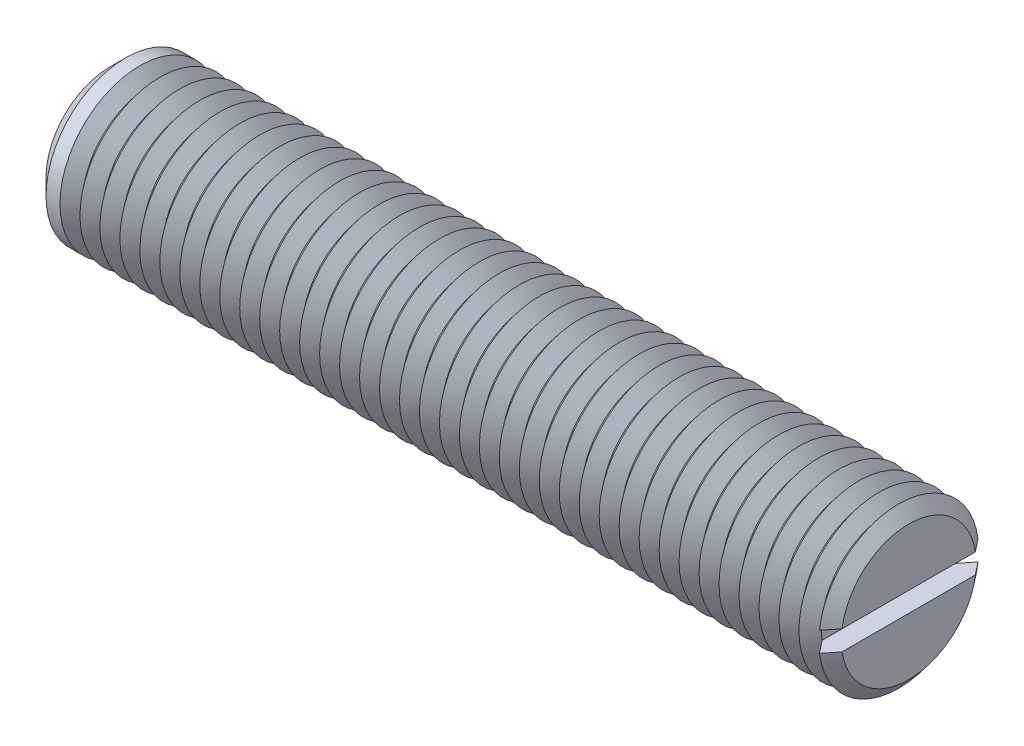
ISO-10303-21;
HEADER;
FILE_DESCRIPTION(('STEP AP214'),'2;1');
FILE_NAME('part.step','',(''),(''),'','','');
FILE_SCHEMA(('AUTOMOTIVE_DESIGN { 1 0 10303 214 1 1 1 1 }'));
ENDSEC;
DATA;
#1=APPLICATION_CONTEXT('core data for automotive mechanical design processes');
#2=APPLICATION_PROTOCOL_DEFINITION('international standard','automotive_design',2000,#1);
#3=PRODUCT_CONTEXT('',#1,'mechanical');
#4=PRODUCT('Part','Part','',(#3));
#5=PRODUCT_RELATED_PRODUCT_CATEGORY('part','',(#4));
#6=PRODUCT_DEFINITION_FORMATION('','',#4);
#7=PRODUCT_DEFINITION_CONTEXT('part definition',#1,'design');
#8=PRODUCT_DEFINITION('design','',#6,#7);
#9=PRODUCT_DEFINITION_SHAPE('','',#8);
#10=(LENGTH_UNIT() NAMED_UNIT(*) SI_UNIT(.MILLI.,.METRE.));
#11=(NAMED_UNIT(*) PLANE_ANGLE_UNIT() SI_UNIT($,.RADIAN.));
#12=(NAMED_UNIT(*) SI_UNIT($,.STERADIAN.) SOLID_ANGLE_UNIT());
#13=UNCERTAINTY_MEASURE_WITH_UNIT(LENGTH_MEASURE(1.E-05),#10,'distance_accuracy_value','');
#14=(GEOMETRIC_REPRESENTATION_CONTEXT(3) GLOBAL_UNCERTAINTY_ASSIGNED_CONTEXT((#13)) GLOBAL_UNIT_ASSIGNED_CONTEXT((#10,
#11,#12)) REPRESENTATION_CONTEXT('',''));
#15=CARTESIAN_POINT('',(0.,0.,0.));
#16=DIRECTION('',(0.,0.,1.));
#17=DIRECTION('',(1.,0.,0.));
#18=AXIS2_PLACEMENT_3D('',#15,#16,#17);
#19=CARTESIAN_POINT('',(39.,0.,0.));
#20=DIRECTION('',(1.,0.,0.));
#21=DIRECTION('',(0.,0.,-1.));
#22=AXIS2_PLACEMENT_3D('',#19,#20,#21);
#23=CONICAL_SURFACE('',#22,8.,0.895664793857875);
#24=CARTESIAN_POINT('',(39.,0.,0.));
#25=DIRECTION('',(-1.,0.,0.));
#26=DIRECTION('',(0.,0.,1.));
#27=AXIS2_PLACEMENT_3D('',#24,#25,#26);
#28=CIRCLE('',#27,8.);
#29=CARTESIAN_POINT('',(39.,-1.,-7.93725393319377));
#30=VERTEX_POINT('',#29);
#31=CARTESIAN_POINT('',(39.,-1.,7.93725393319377));
#32=VERTEX_POINT('',#31);
#33=EDGE_CURVE('E117',#30,#32,#28,.T.);
#34=ORIENTED_EDGE('',*,*,#33,.T.);
#35=CARTESIAN_POINT('',(46.6137872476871,-1.,-17.4810381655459));
#36=CARTESIAN_POINT('',(46.0731000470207,-1.,-16.8046018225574));
#37=CARTESIAN_POINT('',(45.5324624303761,-1.,-16.1281258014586));
#38=CARTESIAN_POINT('',(44.4513425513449,-1.,-14.7749910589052));
#39=CARTESIAN_POINT('',(43.9108602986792,-1.,-14.0983323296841));
#40=CARTESIAN_POINT('',(42.8295593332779,-1.,-12.7440423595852));
#41=CARTESIAN_POINT('',(42.2887409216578,-1.,-12.0664108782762));
#42=CARTESIAN_POINT('',(41.207566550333,-1.,-10.7108366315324));
#43=CARTESIAN_POINT('',(40.6672105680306,-1.,-10.0328938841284));
#44=CARTESIAN_POINT('',(39.8866021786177,-1.,-9.05235403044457));
#45=CARTESIAN_POINT('',(39.6460332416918,-1.,-8.75000893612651));
#46=CARTESIAN_POINT('',(39.1651110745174,-1.,-8.14514467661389));
#47=CARTESIAN_POINT('',(38.9247578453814,-1.,-7.8426255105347));
#48=CARTESIAN_POINT('',(38.4443170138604,-1.,-7.23730074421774));
#49=CARTESIAN_POINT('',(38.2042294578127,-1.,-6.93449510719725));
#50=CARTESIAN_POINT('',(37.7244992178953,-1.,-6.32854042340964));
#51=CARTESIAN_POINT('',(37.4848565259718,-1.,-6.0253913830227));
#52=CARTESIAN_POINT('',(37.0064209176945,-1.,-5.41876829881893));
#53=CARTESIAN_POINT('',(36.7676275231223,-1.,-5.11529463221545));
#54=CARTESIAN_POINT('',(36.291132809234,-1.,-4.50745556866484));
#55=CARTESIAN_POINT('',(36.0534315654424,-1.,-4.2030901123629));
#56=CARTESIAN_POINT('',(35.6984723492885,-1.,-3.74537358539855));
#57=CARTESIAN_POINT('',(35.5804342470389,-1.,-3.59262786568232));
#58=CARTESIAN_POINT('',(35.3451171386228,-1.,-3.28655323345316));
#59=CARTESIAN_POINT('',(35.2278381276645,-1.,-3.13322432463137));
#60=CARTESIAN_POINT('',(34.9944317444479,-1.,-2.82571819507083));
#61=CARTESIAN_POINT('',(34.8783042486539,-1.,-2.67154106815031));
#62=CARTESIAN_POINT('',(34.6478553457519,-1.,-2.36184450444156));
#63=CARTESIAN_POINT('',(34.5335338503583,-1.,-2.20632513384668));
#64=CARTESIAN_POINT('',(34.3956998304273,-1.,-2.01476175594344));
#65=CARTESIAN_POINT('',(34.3706709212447,-1.,-1.97980928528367));
#66=CARTESIAN_POINT('',(34.3208007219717,-1.,-1.90977040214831));
#67=CARTESIAN_POINT('',(34.2959594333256,-1.,-1.87468398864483));
#68=CARTESIAN_POINT('',(34.2217527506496,-1.,-1.76919140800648));
#69=CARTESIAN_POINT('',(34.1727089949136,-1.,-1.69855807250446));
#70=CARTESIAN_POINT('',(34.0751159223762,-1.,-1.55549554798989));
#71=CARTESIAN_POINT('',(34.0265831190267,-1.,-1.48305505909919));
#72=CARTESIAN_POINT('',(33.9312399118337,-1.,-1.33706835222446));
#73=CARTESIAN_POINT('',(33.8844290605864,-1.,-1.26352242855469));
#74=CARTESIAN_POINT('',(33.7926759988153,-1.,-1.1137948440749));
#75=CARTESIAN_POINT('',(33.7477706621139,-1.,-1.03759043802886));
#76=CARTESIAN_POINT('',(33.661907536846,-1.,-0.882780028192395));
#77=CARTESIAN_POINT('',(33.6209558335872,-1.,-0.804170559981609));
#78=CARTESIAN_POINT('',(33.56478469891,-1.,-0.684500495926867));
#79=CARTESIAN_POINT('',(33.5470539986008,-1.,-0.64463151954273));
#80=CARTESIAN_POINT('',(33.5136729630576,-1.,-0.564036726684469));
#81=CARTESIAN_POINT('',(33.4980230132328,-1.,-0.523310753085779));
#82=CARTESIAN_POINT('',(33.4551526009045,-1.,-0.399956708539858));
#83=CARTESIAN_POINT('',(33.4318433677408,-1.,-0.315816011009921));
#84=CARTESIAN_POINT('',(33.4098657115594,-1.,-0.193542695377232));
#85=CARTESIAN_POINT('',(33.4047261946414,-1.,-0.156548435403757));
#86=CARTESIAN_POINT('',(33.3976757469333,-1.,-0.0822397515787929));
#87=CARTESIAN_POINT('',(33.3957650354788,-1.,-0.0449253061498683));
#88=CARTESIAN_POINT('',(33.3953106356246,-1.,0.029693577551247));
#89=CARTESIAN_POINT('',(33.3967642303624,-1.,0.0669979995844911));
#90=CARTESIAN_POINT('',(33.402929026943,-1.,0.141334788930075));
#91=CARTESIAN_POINT('',(33.4076406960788,-1.,0.178367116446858));
#92=CARTESIAN_POINT('',(33.4224195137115,-1.,0.266117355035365));
#93=CARTESIAN_POINT('',(33.4338513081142,-1.,0.316604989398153));
#94=CARTESIAN_POINT('',(33.461310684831,-1.,0.416309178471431));
#95=CARTESIAN_POINT('',(33.4773414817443,-1.,0.465524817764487));
#96=CARTESIAN_POINT('',(33.5130409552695,-1.,0.563049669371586));
#97=CARTESIAN_POINT('',(33.5327381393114,-1.,0.611348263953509));
#98=CARTESIAN_POINT('',(33.5747706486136,-1.,0.706748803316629));
#99=CARTESIAN_POINT('',(33.5971051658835,-1.,0.753851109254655));
#100=CARTESIAN_POINT('',(33.6464135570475,-1.,0.852405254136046));
#101=CARTESIAN_POINT('',(33.6736257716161,-1.,0.903736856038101));
#102=CARTESIAN_POINT('',(33.7298407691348,-1.,1.00541472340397));
#103=CARTESIAN_POINT('',(33.7588439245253,-1.,1.05576078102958));
#104=CARTESIAN_POINT('',(33.8478642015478,-1.,1.20570300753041));
#105=CARTESIAN_POINT('',(33.909851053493,-1.,1.30412495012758));
#106=CARTESIAN_POINT('',(34.0370218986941,-1.,1.49921478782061));
#107=CARTESIAN_POINT('',(34.1022138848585,-1.,1.59587737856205));
#108=CARTESIAN_POINT('',(34.234509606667,-1.,1.78781770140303));
#109=CARTESIAN_POINT('',(34.3016124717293,-1.,1.88309603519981));
#110=CARTESIAN_POINT('',(34.4371969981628,-1.,2.07285006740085));
#111=CARTESIAN_POINT('',(34.5056803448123,-1.,2.16732455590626));
#112=CARTESIAN_POINT('',(34.6435598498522,-1.,2.3556198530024));
#113=CARTESIAN_POINT('',(34.7129561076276,-1.,2.44944058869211));
#114=CARTESIAN_POINT('',(34.8522867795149,-1.,2.63643541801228));
#115=CARTESIAN_POINT('',(34.9222200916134,-1.,2.72961033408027));
#116=CARTESIAN_POINT('',(35.0625737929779,-1.,2.9155867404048));
#117=CARTESIAN_POINT('',(35.1329941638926,-1.,3.00838824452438));
#118=CARTESIAN_POINT('',(35.3434401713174,-1.,3.2845708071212));
#119=CARTESIAN_POINT('',(35.4840068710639,-1.,3.46753938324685));
#120=CARTESIAN_POINT('',(35.766047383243,-1.,3.83277652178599));
#121=CARTESIAN_POINT('',(35.9075212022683,-1.,4.01504507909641));
#122=CARTESIAN_POINT('',(36.3328445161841,-1.,4.56116633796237));
#123=CARTESIAN_POINT('',(36.6175870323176,-1.,4.9243231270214));
#124=CARTESIAN_POINT('',(37.188450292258,-1.,5.64994266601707));
#125=CARTESIAN_POINT('',(37.4745718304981,-1.,6.0124047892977));
#126=CARTESIAN_POINT('',(38.0475166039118,-1.,6.73676512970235));
#127=CARTESIAN_POINT('',(38.334339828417,-1.,7.09866335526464));
#128=CARTESIAN_POINT('',(38.9076446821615,-1.,7.82112227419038));
#129=CARTESIAN_POINT('',(39.194125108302,-1.,8.1816839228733));
#130=CARTESIAN_POINT('',(39.7673842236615,-1.,8.90257236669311));
#131=CARTESIAN_POINT('',(40.0541629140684,-1.,9.26289916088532));
#132=CARTESIAN_POINT('',(40.9146958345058,-1.,10.3434977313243));
#133=CARTESIAN_POINT('',(41.4887564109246,-1.,11.0635255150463));
#134=CARTESIAN_POINT('',(42.4416309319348,-1.,12.2579358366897));
#135=CARTESIAN_POINT('',(42.8203198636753,-1.,12.7324181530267));
#136=CARTESIAN_POINT('',(43.577860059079,-1.,13.6812951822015));
#137=CARTESIAN_POINT('',(43.9567113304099,-1.,14.1556898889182));
#138=CARTESIAN_POINT('',(44.7152320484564,-1.,15.1052923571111));
#139=CARTESIAN_POINT('',(45.0949016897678,-1.,15.5804999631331));
#140=CARTESIAN_POINT('',(45.8543004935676,-1.,16.5308253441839));
#141=CARTESIAN_POINT('',(46.2340296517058,-1.,17.005943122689));
#142=CARTESIAN_POINT('',(46.6137872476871,-1.,17.4810381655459));
#143=B_SPLINE_CURVE_WITH_KNOTS('',3,(#35,#36,#37,#38,#39,#40,#41,#42,#43,#44,#45,#46,#47,#48,
#49,#50,#51,#52,#53,#54,#55,#56,#57,#58,#59,#60,#61,#62,#63,#64,#65,#66,#67,#68,#69,#70,#71,#72,
#73,#74,#75,#76,#77,#78,#79,#80,#81,#82,#83,#84,#85,#86,#87,#88,#89,#90,#91,#92,#93,#94,#95,#96,
#97,#98,#99,#100,#101,#102,#103,#104,#105,#106,#107,#108,#109,#110,#111,#112,#113,#114,#115,
#116,#117,#118,#119,#120,#121,#122,#123,#124,#125,#126,#127,#128,#129,#130,#131,#132,#133,#134,
#135,#136,#137,#138,#139,#140,#141,#142),.UNSPECIFIED.,.F.,.F.,(4,2,2,2,2,2,2,2,2,2,2,2,2,2,2,2,
2,2,2,2,2,2,2,2,2,2,2,2,2,2,2,2,2,2,2,2,2,2,2,2,2,2,2,2,2,2,2,2,2,2,2,2,2,4),(0.,
2.59791825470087,5.19597381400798,7.79693910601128,10.3977690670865,11.5568952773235,
12.7160274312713,13.8753371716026,15.0346257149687,16.1931009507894,17.3516551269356,
17.9307722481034,18.5098857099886,19.0889363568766,19.6679586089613,19.7969273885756,
19.9258971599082,20.1838595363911,20.4454304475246,20.7069329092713,20.9722220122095,
21.2379131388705,21.3687577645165,21.4996265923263,21.7602408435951,21.8721711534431,
21.9841090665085,22.0959566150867,22.2078202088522,22.3628274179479,22.5179432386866,
22.6743197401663,22.8306484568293,23.0048946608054,23.1791772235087,23.5280071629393,
23.8777561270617,24.2273482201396,24.5773965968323,24.927483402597,25.2769811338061,
25.6264657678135,26.3186514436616,27.0108421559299,28.3952670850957,29.7806179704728,
31.1659479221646,32.5474981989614,33.9290539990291,36.6916375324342,38.5128593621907,
40.334179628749,42.1589376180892,43.9835965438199),.UNSPECIFIED.);
#144=CARTESIAN_POINT('',(38.,-1.,6.67652652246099));
#145=VERTEX_POINT('',#144);
#146=EDGE_CURVE('E109',#145,#32,#143,.T.);
#147=ORIENTED_EDGE('',*,*,#146,.F.);
#148=CARTESIAN_POINT('',(38.,0.,0.));
#149=DIRECTION('',(-1.,0.,0.));
#150=DIRECTION('',(0.,0.,1.));
#151=AXIS2_PLACEMENT_3D('',#148,#149,#150);
#152=CIRCLE('',#151,6.75100040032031);
#153=CARTESIAN_POINT('',(38.,-1.,-6.67652652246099));
#154=VERTEX_POINT('',#153);
#155=EDGE_CURVE('E529',#154,#145,#152,.T.);
#156=ORIENTED_EDGE('',*,*,#155,.F.);
#157=EDGE_CURVE('E58',#30,#154,#143,.T.);
#158=ORIENTED_EDGE('',*,*,#157,.F.);
#159=EDGE_LOOP('',(#34,#147,#156,#158));
#160=FACE_BOUND('',#159,.T.);
#161=ADVANCED_FACE('F37',(#160),#23,.T.);
#162=CARTESIAN_POINT('',(39.,1.,7.93725393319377));
#163=VERTEX_POINT('',#162);
#164=CARTESIAN_POINT('',(39.,1.,-7.93725393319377));
#165=VERTEX_POINT('',#164);
#166=EDGE_CURVE('E100',#163,#165,#28,.T.);
#167=ORIENTED_EDGE('',*,*,#166,.T.);
#168=CARTESIAN_POINT('',(46.6137872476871,1.,17.4810381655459));
#169=CARTESIAN_POINT('',(46.0731000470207,1.,16.8046018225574));
#170=CARTESIAN_POINT('',(45.5324624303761,1.,16.1281258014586));
#171=CARTESIAN_POINT('',(44.4513425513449,1.,14.7749910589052));
#172=CARTESIAN_POINT('',(43.9108602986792,1.,14.0983323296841));
#173=CARTESIAN_POINT('',(42.8295593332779,1.,12.7440423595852));
#174=CARTESIAN_POINT('',(42.2887409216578,1.,12.0664108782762));
#175=CARTESIAN_POINT('',(41.207566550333,1.,10.7108366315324));
#176=CARTESIAN_POINT('',(40.6672105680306,1.,10.0328938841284));
#177=CARTESIAN_POINT('',(39.8866021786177,1.,9.05235403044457));
#178=CARTESIAN_POINT('',(39.6460332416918,1.,8.75000893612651));
#179=CARTESIAN_POINT('',(39.1651110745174,1.,8.14514467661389));
#180=CARTESIAN_POINT('',(38.9247578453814,1.,7.8426255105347));
#181=CARTESIAN_POINT('',(38.4443170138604,1.,7.23730074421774));
#182=CARTESIAN_POINT('',(38.2042294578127,1.,6.93449510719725));
#183=CARTESIAN_POINT('',(37.7244992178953,1.,6.32854042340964));
#184=CARTESIAN_POINT('',(37.4848565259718,1.,6.0253913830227));
#185=CARTESIAN_POINT('',(37.0064209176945,1.,5.41876829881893));
#186=CARTESIAN_POINT('',(36.7676275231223,1.,5.11529463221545));
#187=CARTESIAN_POINT('',(36.291132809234,1.,4.50745556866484));
#188=CARTESIAN_POINT('',(36.0534315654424,1.,4.2030901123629));
#189=CARTESIAN_POINT('',(35.6984723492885,1.,3.74537358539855));
#190=CARTESIAN_POINT('',(35.5804342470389,1.,3.59262786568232));
#191=CARTESIAN_POINT('',(35.3451171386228,1.,3.28655323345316));
#192=CARTESIAN_POINT('',(35.2278381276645,1.,3.13322432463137));
#193=CARTESIAN_POINT('',(34.9944317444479,1.,2.82571819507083));
#194=CARTESIAN_POINT('',(34.8783042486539,1.,2.67154106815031));
#195=CARTESIAN_POINT('',(34.6478553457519,1.,2.36184450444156));
#196=CARTESIAN_POINT('',(34.5335338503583,1.,2.20632513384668));
#197=CARTESIAN_POINT('',(34.3956998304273,1.,2.01476175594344));
#198=CARTESIAN_POINT('',(34.3706709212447,1.,1.97980928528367));
#199=CARTESIAN_POINT('',(34.3208007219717,1.,1.90977040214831));
#200=CARTESIAN_POINT('',(34.2959594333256,1.,1.87468398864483));
#201=CARTESIAN_POINT('',(34.2217527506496,1.,1.76919140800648));
#202=CARTESIAN_POINT('',(34.1727089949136,1.,1.69855807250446));
#203=CARTESIAN_POINT('',(34.0751159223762,1.,1.55549554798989));
#204=CARTESIAN_POINT('',(34.0265831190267,1.,1.48305505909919));
#205=CARTESIAN_POINT('',(33.9312399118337,1.,1.33706835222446));
#206=CARTESIAN_POINT('',(33.8844290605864,1.,1.26352242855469));
#207=CARTESIAN_POINT('',(33.7926759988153,1.,1.1137948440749));
#208=CARTESIAN_POINT('',(33.7477706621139,1.,1.03759043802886));
#209=CARTESIAN_POINT('',(33.661907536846,1.,0.882780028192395));
#210=CARTESIAN_POINT('',(33.6209558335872,1.,0.804170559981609));
#211=CARTESIAN_POINT('',(33.56478469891,1.,0.684500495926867));
#212=CARTESIAN_POINT('',(33.5470539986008,1.,0.64463151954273));
#213=CARTESIAN_POINT('',(33.5136729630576,1.,0.564036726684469));
#214=CARTESIAN_POINT('',(33.4980230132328,1.,0.523310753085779));
#215=CARTESIAN_POINT('',(33.4551526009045,1.,0.399956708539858));
#216=CARTESIAN_POINT('',(33.4318433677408,1.,0.315816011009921));
#217=CARTESIAN_POINT('',(33.4098657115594,1.,0.193542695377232));
#218=CARTESIAN_POINT('',(33.4047261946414,1.,0.156548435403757));
#219=CARTESIAN_POINT('',(33.3976757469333,1.,0.0822397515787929));
#220=CARTESIAN_POINT('',(33.3957650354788,1.,0.0449253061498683));
#221=CARTESIAN_POINT('',(33.3953106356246,1.,-0.029693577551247));
#222=CARTESIAN_POINT('',(33.3967642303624,1.,-0.0669979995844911));
#223=CARTESIAN_POINT('',(33.402929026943,1.,-0.141334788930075));
#224=CARTESIAN_POINT('',(33.4076406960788,1.,-0.178367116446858));
#225=CARTESIAN_POINT('',(33.4224195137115,1.,-0.266117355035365));
#226=CARTESIAN_POINT('',(33.4338513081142,1.,-0.316604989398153));
#227=CARTESIAN_POINT('',(33.461310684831,1.,-0.416309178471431));
#228=CARTESIAN_POINT('',(33.4773414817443,1.,-0.465524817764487));
#229=CARTESIAN_POINT('',(33.5130409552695,1.,-0.563049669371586));
#230=CARTESIAN_POINT('',(33.5327381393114,1.,-0.611348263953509));
#231=CARTESIAN_POINT('',(33.5747706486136,1.,-0.706748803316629));
#232=CARTESIAN_POINT('',(33.5971051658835,1.,-0.753851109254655));
#233=CARTESIAN_POINT('',(33.6464135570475,1.,-0.852405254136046));
#234=CARTESIAN_POINT('',(33.6736257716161,1.,-0.903736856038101));
#235=CARTESIAN_POINT('',(33.7298407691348,1.,-1.00541472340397));
#236=CARTESIAN_POINT('',(33.7588439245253,1.,-1.05576078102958));
#237=CARTESIAN_POINT('',(33.8478642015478,1.,-1.20570300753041));
#238=CARTESIAN_POINT('',(33.909851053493,1.,-1.30412495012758));
#239=CARTESIAN_POINT('',(34.0370218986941,1.,-1.49921478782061));
#240=CARTESIAN_POINT('',(34.1022138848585,1.,-1.59587737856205));
#241=CARTESIAN_POINT('',(34.234509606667,1.,-1.78781770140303));
#242=CARTESIAN_POINT('',(34.3016124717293,1.,-1.88309603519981));
#243=CARTESIAN_POINT('',(34.4371969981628,1.,-2.07285006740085));
#244=CARTESIAN_POINT('',(34.5056803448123,1.,-2.16732455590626));
#245=CARTESIAN_POINT('',(34.6435598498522,1.,-2.3556198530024));
#246=CARTESIAN_POINT('',(34.7129561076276,1.,-2.44944058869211));
#247=CARTESIAN_POINT('',(34.8522867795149,1.,-2.63643541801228));
#248=CARTESIAN_POINT('',(34.9222200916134,1.,-2.72961033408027));
#249=CARTESIAN_POINT('',(35.0625737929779,1.,-2.9155867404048));
#250=CARTESIAN_POINT('',(35.1329941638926,1.,-3.00838824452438));
#251=CARTESIAN_POINT('',(35.3434401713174,1.,-3.2845708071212));
#252=CARTESIAN_POINT('',(35.4840068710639,1.,-3.46753938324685));
#253=CARTESIAN_POINT('',(35.766047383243,1.,-3.83277652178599));
#254=CARTESIAN_POINT('',(35.9075212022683,1.,-4.01504507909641));
#255=CARTESIAN_POINT('',(36.3328445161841,1.,-4.56116633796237));
#256=CARTESIAN_POINT('',(36.6175870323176,1.,-4.9243231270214));
#257=CARTESIAN_POINT('',(37.188450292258,1.,-5.64994266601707));
#258=CARTESIAN_POINT('',(37.4745718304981,1.,-6.0124047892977));
#259=CARTESIAN_POINT('',(38.0475166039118,1.,-6.73676512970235));
#260=CARTESIAN_POINT('',(38.334339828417,1.,-7.09866335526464));
#261=CARTESIAN_POINT('',(38.9076446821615,1.,-7.82112227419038));
#262=CARTESIAN_POINT('',(39.194125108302,1.,-8.1816839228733));
#263=CARTESIAN_POINT('',(39.7673842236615,1.,-8.90257236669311));
#264=CARTESIAN_POINT('',(40.0541629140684,1.,-9.26289916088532));
#265=CARTESIAN_POINT('',(40.9146958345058,1.,-10.3434977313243));
#266=CARTESIAN_POINT('',(41.4887564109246,1.,-11.0635255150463));
#267=CARTESIAN_POINT('',(42.4416309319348,1.,-12.2579358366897));
#268=CARTESIAN_POINT('',(42.8203198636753,1.,-12.7324181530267));
#269=CARTESIAN_POINT('',(43.577860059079,1.,-13.6812951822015));
#270=CARTESIAN_POINT('',(43.9567113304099,1.,-14.1556898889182));
#271=CARTESIAN_POINT('',(44.7152320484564,1.,-15.1052923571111));
#272=CARTESIAN_POINT('',(45.0949016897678,1.,-15.5804999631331));
#273=CARTESIAN_POINT('',(45.8543004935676,1.,-16.5308253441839));
#274=CARTESIAN_POINT('',(46.2340296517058,1.,-17.005943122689));
#275=CARTESIAN_POINT('',(46.6137872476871,1.,-17.4810381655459));
#276=B_SPLINE_CURVE_WITH_KNOTS('',3,(#168,#169,#170,#171,#172,#173,#174,#175,#176,#177,#178,
#179,#180,#181,#182,#183,#184,#185,#186,#187,#188,#189,#190,#191,#192,#193,#194,#195,#196,#197,
#198,#199,#200,#201,#202,#203,#204,#205,#206,#207,#208,#209,#210,#211,#212,#213,#214,#215,#216,
#217,#218,#219,#220,#221,#222,#223,#224,#225,#226,#227,#228,#229,#230,#231,#232,#233,#234,#235,
#236,#237,#238,#239,#240,#241,#242,#243,#244,#245,#246,#247,#248,#249,#250,#251,#252,#253,#254,
#255,#256,#257,#258,#259,#260,#261,#262,#263,#264,#265,#266,#267,#268,#269,#270,#271,#272,#273,
#274,#275),.UNSPECIFIED.,.F.,.F.,(4,2,2,2,2,2,2,2,2,2,2,2,2,2,2,2,2,2,2,2,2,2,2,2,2,2,2,2,2,2,2,
2,2,2,2,2,2,2,2,2,2,2,2,2,2,2,2,2,2,2,2,2,2,4),(0.,2.59791825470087,5.19597381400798,
7.79693910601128,10.3977690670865,11.5568952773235,12.7160274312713,13.8753371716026,
15.0346257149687,16.1931009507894,17.3516551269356,17.9307722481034,18.5098857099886,
19.0889363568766,19.6679586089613,19.7969273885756,19.9258971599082,20.1838595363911,
20.4454304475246,20.7069329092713,20.9722220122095,21.2379131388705,21.3687577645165,
21.4996265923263,21.7602408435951,21.8721711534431,21.9841090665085,22.0959566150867,
22.2078202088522,22.3628274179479,22.5179432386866,22.6743197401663,22.8306484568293,
23.0048946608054,23.1791772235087,23.5280071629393,23.8777561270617,24.2273482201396,
24.5773965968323,24.927483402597,25.2769811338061,25.6264657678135,26.3186514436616,
27.0108421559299,28.3952670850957,29.7806179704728,31.1659479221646,32.5474981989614,
33.9290539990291,36.6916375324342,38.5128593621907,40.334179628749,42.1589376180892,
43.9835965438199),.UNSPECIFIED.);
#277=CARTESIAN_POINT('',(38.,1.,-6.67652652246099));
#278=VERTEX_POINT('',#277);
#279=EDGE_CURVE('E110',#278,#165,#276,.T.);
#280=ORIENTED_EDGE('',*,*,#279,.F.);
#281=CARTESIAN_POINT('',(38.,1.,6.67652652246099));
#282=VERTEX_POINT('',#281);
#283=EDGE_CURVE('E103',#282,#278,#152,.T.);
#284=ORIENTED_EDGE('',*,*,#283,.F.);
#285=EDGE_CURVE('E97',#163,#282,#276,.T.);
#286=ORIENTED_EDGE('',*,*,#285,.F.);
#287=EDGE_LOOP('',(#167,#280,#284,#286));
#288=FACE_BOUND('',#287,.T.);
#289=ADVANCED_FACE('F99',(#288),#23,.T.);
#290=CARTESIAN_POINT('',(38.,0.,0.));
#291=DIRECTION('',(-1.,0.,0.));
#292=DIRECTION('',(0.,0.,1.));
#293=AXIS2_PLACEMENT_3D('',#290,#291,#292);
#294=CONICAL_SURFACE('',#293,6.75100040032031,0.895664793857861);
#295=CARTESIAN_POINT('',(37.,0.,0.));
#296=DIRECTION('',(-1.,0.,0.));
#297=DIRECTION('',(0.,0.,1.));
#298=AXIS2_PLACEMENT_3D('',#295,#296,#297);
#299=CIRCLE('',#298,8.);
#300=CARTESIAN_POINT('',(37.,0.,8.));
#301=VERTEX_POINT('',#300);
#302=EDGE_CURVE('E515',#301,#301,#299,.T.);
#303=ORIENTED_EDGE('',*,*,#302,.F.);
#304=EDGE_LOOP('',(#303));
#305=FACE_BOUND('',#304,.T.);
#306=ORIENTED_EDGE('',*,*,#283,.T.);
#307=EDGE_CURVE('E523',#278,#154,#152,.T.);
#308=ORIENTED_EDGE('',*,*,#307,.T.);
#309=ORIENTED_EDGE('',*,*,#155,.T.);
#310=EDGE_CURVE('E522',#145,#282,#152,.T.);
#311=ORIENTED_EDGE('',*,*,#310,.T.);
#312=EDGE_LOOP('',(#306,#308,#309,#311));
#313=FACE_BOUND('',#312,.T.);
#314=ADVANCED_FACE('F168',(#305,#313),#294,.T.);
#315=CARTESIAN_POINT('',(40.,0.,0.));
#316=DIRECTION('',(1.,0.,0.));
#317=DIRECTION('',(0.,0.,-1.));
#318=AXIS2_PLACEMENT_3D('',#315,#316,#317);
#319=PLANE('',#318);
#320=CARTESIAN_POINT('',(40.,0.,0.));
#321=DIRECTION('',(-1.,0.,0.));
#322=DIRECTION('',(0.,0.,1.));
#323=AXIS2_PLACEMENT_3D('',#320,#321,#322);
#324=CIRCLE('',#323,6.75100040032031);
#325=CARTESIAN_POINT('',(40.,1.,6.67652652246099));
#326=VERTEX_POINT('',#325);
#327=CARTESIAN_POINT('',(40.,1.,-6.67652652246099));
#328=VERTEX_POINT('',#327);
#329=EDGE_CURVE('E160',#326,#328,#324,.T.);
#330=ORIENTED_EDGE('',*,*,#329,.F.);
#331=DIRECTION('',(0.,0.,1.));
#332=VECTOR('',#331,1.);
#333=CARTESIAN_POINT('',(40.,1.,0.));
#334=LINE('',#333,#332);
#335=EDGE_CURVE('E122',#328,#326,#334,.T.);
#336=ORIENTED_EDGE('',*,*,#335,.F.);
#337=EDGE_LOOP('',(#330,#336));
#338=FACE_BOUND('',#337,.T.);
#339=ADVANCED_FACE('F172',(#338),#319,.T.);
#340=CARTESIAN_POINT('',(40.,-1.,-6.67652652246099));
#341=VERTEX_POINT('',#340);
#342=CARTESIAN_POINT('',(40.,-1.,6.67652652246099));
#343=VERTEX_POINT('',#342);
#344=EDGE_CURVE('E66',#341,#343,#324,.T.);
#345=ORIENTED_EDGE('',*,*,#344,.F.);
#346=DIRECTION('',(0.,0.,-1.));
#347=VECTOR('',#346,1.);
#348=CARTESIAN_POINT('',(40.,-1.,0.));
#349=LINE('',#348,#347);
#350=EDGE_CURVE('E136',#343,#341,#349,.T.);
#351=ORIENTED_EDGE('',*,*,#350,.F.);
#352=EDGE_LOOP('',(#345,#351));
#353=FACE_BOUND('',#352,.T.);
#354=ADVANCED_FACE('F200',(#353),#319,.T.);
#355=CARTESIAN_POINT('',(40.,0.,0.));
#356=DIRECTION('',(-1.,0.,0.));
#357=DIRECTION('',(0.,0.,1.));
#358=AXIS2_PLACEMENT_3D('',#355,#356,#357);
#359=CONICAL_SURFACE('',#358,6.75100040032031,0.895664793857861);
#360=ORIENTED_EDGE('',*,*,#166,.F.);
#361=CARTESIAN_POINT('',(31.3862127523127,1.,-17.4810381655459));
#362=CARTESIAN_POINT('',(31.9268999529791,1.,-16.8046018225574));
#363=CARTESIAN_POINT('',(32.4675375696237,1.,-16.1281258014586));
#364=CARTESIAN_POINT('',(33.5486574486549,1.,-14.7749910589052));
#365=CARTESIAN_POINT('',(34.0891397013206,1.,-14.0983323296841));
#366=CARTESIAN_POINT('',(35.1704406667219,1.,-12.7440423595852));
#367=CARTESIAN_POINT('',(35.7112590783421,1.,-12.0664108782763));
#368=CARTESIAN_POINT('',(36.7924334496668,1.,-10.7108366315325));
#369=CARTESIAN_POINT('',(37.3327894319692,1.,-10.0328938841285));
#370=CARTESIAN_POINT('',(38.1133978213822,1.,-9.05235403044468));
#371=CARTESIAN_POINT('',(38.3539667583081,1.,-8.75000893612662));
#372=CARTESIAN_POINT('',(38.8348889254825,1.,-8.145144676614));
#373=CARTESIAN_POINT('',(39.0752421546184,1.,-7.8426255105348));
#374=CARTESIAN_POINT('',(39.5556829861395,1.,-7.23730074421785));
#375=CARTESIAN_POINT('',(39.7957705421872,1.,-6.93449510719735));
#376=CARTESIAN_POINT('',(40.2755007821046,1.,-6.32854042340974));
#377=CARTESIAN_POINT('',(40.5151434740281,1.,-6.0253913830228));
#378=CARTESIAN_POINT('',(40.9935790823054,1.,-5.41876829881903));
#379=CARTESIAN_POINT('',(41.2323724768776,1.,-5.11529463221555));
#380=CARTESIAN_POINT('',(41.708867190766,1.,-4.50745556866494));
#381=CARTESIAN_POINT('',(41.9465684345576,1.,-4.203090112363));
#382=CARTESIAN_POINT('',(42.3015276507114,1.,-3.74537358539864));
#383=CARTESIAN_POINT('',(42.419565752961,1.,-3.59262786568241));
#384=CARTESIAN_POINT('',(42.6548828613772,1.,-3.28655323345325));
#385=CARTESIAN_POINT('',(42.7721618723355,1.,-3.13322432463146));
#386=CARTESIAN_POINT('',(43.0055682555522,1.,-2.82571819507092));
#387=CARTESIAN_POINT('',(43.1216957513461,1.,-2.6715410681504));
#388=CARTESIAN_POINT('',(43.3521446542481,1.,-2.36184450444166));
#389=CARTESIAN_POINT('',(43.4664661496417,1.,-2.20632513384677));
#390=CARTESIAN_POINT('',(43.6043001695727,1.,-2.01476175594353));
#391=CARTESIAN_POINT('',(43.6293290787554,1.,-1.97980928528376));
#392=CARTESIAN_POINT('',(43.6791992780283,1.,-1.9097704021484));
#393=CARTESIAN_POINT('',(43.7040405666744,1.,-1.87468398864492));
#394=CARTESIAN_POINT('',(43.7782472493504,1.,-1.76919140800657));
#395=CARTESIAN_POINT('',(43.8272910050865,1.,-1.69855807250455));
#396=CARTESIAN_POINT('',(43.9248840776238,1.,-1.55549554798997));
#397=CARTESIAN_POINT('',(43.9734168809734,1.,-1.48305505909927));
#398=CARTESIAN_POINT('',(44.0687600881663,1.,-1.33706835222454));
#399=CARTESIAN_POINT('',(44.1155709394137,1.,-1.26352242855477));
#400=CARTESIAN_POINT('',(44.2073240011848,1.,-1.11379484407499));
#401=CARTESIAN_POINT('',(44.2522293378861,1.,-1.03759043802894));
#402=CARTESIAN_POINT('',(44.3380924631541,1.,-0.882780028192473));
#403=CARTESIAN_POINT('',(44.3790441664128,1.,-0.804170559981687));
#404=CARTESIAN_POINT('',(44.4352153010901,1.,-0.684500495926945));
#405=CARTESIAN_POINT('',(44.4529460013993,1.,-0.644631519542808));
#406=CARTESIAN_POINT('',(44.4863270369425,1.,-0.564036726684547));
#407=CARTESIAN_POINT('',(44.5019769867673,1.,-0.523310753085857));
#408=CARTESIAN_POINT('',(44.5448473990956,1.,-0.399956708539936));
#409=CARTESIAN_POINT('',(44.5681566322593,1.,-0.315816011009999));
#410=CARTESIAN_POINT('',(44.5901342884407,1.,-0.193542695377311));
#411=CARTESIAN_POINT('',(44.5952738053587,1.,-0.156548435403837));
#412=CARTESIAN_POINT('',(44.6023242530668,1.,-0.0822397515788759));
#413=CARTESIAN_POINT('',(44.6042349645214,1.,-0.0449253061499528));
#414=CARTESIAN_POINT('',(44.6046893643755,1.,0.0296935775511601));
#415=CARTESIAN_POINT('',(44.6032357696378,1.,0.0669979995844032));
#416=CARTESIAN_POINT('',(44.5970709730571,1.,0.141334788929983));
#417=CARTESIAN_POINT('',(44.5923593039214,1.,0.178367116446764));
#418=CARTESIAN_POINT('',(44.5775804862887,1.,0.266117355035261));
#419=CARTESIAN_POINT('',(44.5661486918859,1.,0.316604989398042));
#420=CARTESIAN_POINT('',(44.5386893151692,1.,0.416309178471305));
#421=CARTESIAN_POINT('',(44.5226585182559,1.,0.465524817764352));
#422=CARTESIAN_POINT('',(44.4869590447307,1.,0.563049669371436));
#423=CARTESIAN_POINT('',(44.4672618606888,1.,0.611348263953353));
#424=CARTESIAN_POINT('',(44.4252293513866,1.,0.706748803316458));
#425=CARTESIAN_POINT('',(44.4028948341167,1.,0.753851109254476));
#426=CARTESIAN_POINT('',(44.3535864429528,1.,0.852405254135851));
#427=CARTESIAN_POINT('',(44.3263742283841,1.,0.903736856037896));
#428=CARTESIAN_POINT('',(44.2701592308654,1.,1.00541472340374));
#429=CARTESIAN_POINT('',(44.241156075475,1.,1.05576078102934));
#430=CARTESIAN_POINT('',(44.1521357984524,1.,1.20570300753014));
#431=CARTESIAN_POINT('',(44.0901489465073,1.,1.30412495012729));
#432=CARTESIAN_POINT('',(43.9629781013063,1.,1.49921478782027));
#433=CARTESIAN_POINT('',(43.8977861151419,1.,1.5958773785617));
#434=CARTESIAN_POINT('',(43.7654903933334,1.,1.78781770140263));
#435=CARTESIAN_POINT('',(43.6983875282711,1.,1.88309603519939));
#436=CARTESIAN_POINT('',(43.5628030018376,1.,2.07285006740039));
#437=CARTESIAN_POINT('',(43.4943196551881,1.,2.16732455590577));
#438=CARTESIAN_POINT('',(43.3564401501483,1.,2.35561985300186));
#439=CARTESIAN_POINT('',(43.2870438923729,1.,2.44944058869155));
#440=CARTESIAN_POINT('',(43.1477132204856,1.,2.63643541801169));
#441=CARTESIAN_POINT('',(43.0777799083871,1.,2.72961033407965));
#442=CARTESIAN_POINT('',(42.9374262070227,1.,2.91558674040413));
#443=CARTESIAN_POINT('',(42.867005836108,1.,3.0083882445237));
#444=CARTESIAN_POINT('',(42.6565598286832,1.,3.28457080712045));
#445=CARTESIAN_POINT('',(42.5159931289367,1.,3.46753938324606));
#446=CARTESIAN_POINT('',(42.2339526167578,1.,3.83277652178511));
#447=CARTESIAN_POINT('',(42.0924787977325,1.,4.01504507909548));
#448=CARTESIAN_POINT('',(41.6671554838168,1.,4.56116633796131));
#449=CARTESIAN_POINT('',(41.3824129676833,1.,4.92432312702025));
#450=CARTESIAN_POINT('',(40.8115497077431,1.,5.64994266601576));
#451=CARTESIAN_POINT('',(40.5254281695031,1.,6.01240478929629));
#452=CARTESIAN_POINT('',(39.9524833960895,1.,6.73676512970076));
#453=CARTESIAN_POINT('',(39.6656601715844,1.,7.09866335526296));
#454=CARTESIAN_POINT('',(39.0923553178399,1.,7.82112227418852));
#455=CARTESIAN_POINT('',(38.8058748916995,1.,8.18168392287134));
#456=CARTESIAN_POINT('',(38.2326157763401,1.,8.90257236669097));
#457=CARTESIAN_POINT('',(37.9458370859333,1.,9.26289916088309));
#458=CARTESIAN_POINT('',(37.0853041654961,1.,10.3434977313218));
#459=CARTESIAN_POINT('',(36.5112435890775,1.,11.0635255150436));
#460=CARTESIAN_POINT('',(35.5583690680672,1.,12.2579358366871));
#461=CARTESIAN_POINT('',(35.1796801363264,1.,12.7324181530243));
#462=CARTESIAN_POINT('',(34.4221399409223,1.,13.6812951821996));
#463=CARTESIAN_POINT('',(34.0432886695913,1.,14.1556898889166));
#464=CARTESIAN_POINT('',(33.2847679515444,1.,15.1052923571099));
#465=CARTESIAN_POINT('',(32.9050983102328,1.,15.5804999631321));
#466=CARTESIAN_POINT('',(32.1456995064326,1.,16.5308253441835));
#467=CARTESIAN_POINT('',(31.7659703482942,1.,17.0059431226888));
#468=CARTESIAN_POINT('',(31.3862127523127,1.,17.4810381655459));
#469=B_SPLINE_CURVE_WITH_KNOTS('',3,(#361,#362,#363,#364,#365,#366,#367,#368,#369,#370,#371,
#372,#373,#374,#375,#376,#377,#378,#379,#380,#381,#382,#383,#384,#385,#386,#387,#388,#389,#390,
#391,#392,#393,#394,#395,#396,#397,#398,#399,#400,#401,#402,#403,#404,#405,#406,#407,#408,#409,
#410,#411,#412,#413,#414,#415,#416,#417,#418,#419,#420,#421,#422,#423,#424,#425,#426,#427,#428,
#429,#430,#431,#432,#433,#434,#435,#436,#437,#438,#439,#440,#441,#442,#443,#444,#445,#446,#447,
#448,#449,#450,#451,#452,#453,#454,#455,#456,#457,#458,#459,#460,#461,#462,#463,#464,#465,#466,
#467,#468),.UNSPECIFIED.,.F.,.F.,(4,2,2,2,2,2,2,2,2,2,2,2,2,2,2,2,2,2,2,2,2,2,2,2,2,2,2,2,2,2,2,
2,2,2,2,2,2,2,2,2,2,2,2,2,2,2,2,2,2,2,2,2,2,4),(0.,2.59791825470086,5.19597381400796,
7.79693910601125,10.3977690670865,11.5568952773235,12.7160274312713,13.8753371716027,
15.0346257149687,16.1931009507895,17.3516551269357,17.9307722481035,18.5098857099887,
19.0889363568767,19.6679586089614,19.7969273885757,19.9258971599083,20.1838595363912,
20.4454304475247,20.7069329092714,20.9722220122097,21.2379131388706,21.3687577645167,
21.4996265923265,21.7602408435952,21.8721711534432,21.9841090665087,22.0959566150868,
22.2078202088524,22.362827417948,22.5179432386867,22.6743197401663,22.8306484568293,
23.0048946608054,23.1791772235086,23.5280071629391,23.8777561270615,24.2273482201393,
24.5773965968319,24.9274834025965,25.2769811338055,25.6264657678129,26.3186514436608,
27.010842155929,28.3952670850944,29.7806179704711,31.1659479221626,32.5474981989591,
33.9290539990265,36.6916375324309,38.5128593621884,40.3341796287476,42.1589376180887,
43.9835965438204),.UNSPECIFIED.);
#470=EDGE_CURVE('E41',#326,#163,#469,.T.);
#471=ORIENTED_EDGE('',*,*,#470,.F.);
#472=ORIENTED_EDGE('',*,*,#329,.T.);
#473=EDGE_CURVE('E11',#165,#328,#469,.T.);
#474=ORIENTED_EDGE('',*,*,#473,.F.);
#475=EDGE_LOOP('',(#360,#471,#472,#474));
#476=FACE_BOUND('',#475,.T.);
#477=ADVANCED_FACE('F114',(#476),#359,.T.);
#478=CARTESIAN_POINT('',(40.,1.,-12.));
#479=DIRECTION('',(0.,1.,0.));
#480=DIRECTION('',(0.,0.,1.));
#481=AXIS2_PLACEMENT_3D('',#478,#479,#480);
#482=PLANE('',#481);
#483=ORIENTED_EDGE('',*,*,#470,.T.);
#484=ORIENTED_EDGE('',*,*,#285,.T.);
#485=DIRECTION('',(0.,0.,1.));
#486=VECTOR('',#485,1.);
#487=CARTESIAN_POINT('',(38.,1.,-12.));
#488=LINE('',#487,#486);
#489=EDGE_CURVE('E145',#278,#282,#488,.T.);
#490=ORIENTED_EDGE('',*,*,#489,.F.);
#491=ORIENTED_EDGE('',*,*,#279,.T.);
#492=ORIENTED_EDGE('',*,*,#473,.T.);
#493=ORIENTED_EDGE('',*,*,#335,.T.);
#494=EDGE_LOOP('',(#483,#484,#490,#491,#492,#493));
#495=FACE_BOUND('',#494,.T.);
#496=ADVANCED_FACE('F120',(#495),#482,.F.);
#497=ORIENTED_EDGE('',*,*,#33,.F.);
#498=CARTESIAN_POINT('',(31.3862127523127,-1.,17.4810381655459));
#499=CARTESIAN_POINT('',(31.9268999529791,-1.,16.8046018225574));
#500=CARTESIAN_POINT('',(32.4675375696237,-1.,16.1281258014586));
#501=CARTESIAN_POINT('',(33.5486574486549,-1.,14.7749910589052));
#502=CARTESIAN_POINT('',(34.0891397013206,-1.,14.0983323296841));
#503=CARTESIAN_POINT('',(35.1704406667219,-1.,12.7440423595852));
#504=CARTESIAN_POINT('',(35.7112590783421,-1.,12.0664108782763));
#505=CARTESIAN_POINT('',(36.7924334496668,-1.,10.7108366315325));
#506=CARTESIAN_POINT('',(37.3327894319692,-1.,10.0328938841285));
#507=CARTESIAN_POINT('',(38.1133978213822,-1.,9.05235403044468));
#508=CARTESIAN_POINT('',(38.3539667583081,-1.,8.75000893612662));
#509=CARTESIAN_POINT('',(38.8348889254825,-1.,8.145144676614));
#510=CARTESIAN_POINT('',(39.0752421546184,-1.,7.8426255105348));
#511=CARTESIAN_POINT('',(39.5556829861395,-1.,7.23730074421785));
#512=CARTESIAN_POINT('',(39.7957705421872,-1.,6.93449510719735));
#513=CARTESIAN_POINT('',(40.2755007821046,-1.,6.32854042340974));
#514=CARTESIAN_POINT('',(40.5151434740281,-1.,6.0253913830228));
#515=CARTESIAN_POINT('',(40.9935790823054,-1.,5.41876829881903));
#516=CARTESIAN_POINT('',(41.2323724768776,-1.,5.11529463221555));
#517=CARTESIAN_POINT('',(41.708867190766,-1.,4.50745556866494));
#518=CARTESIAN_POINT('',(41.9465684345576,-1.,4.203090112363));
#519=CARTESIAN_POINT('',(42.3015276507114,-1.,3.74537358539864));
#520=CARTESIAN_POINT('',(42.419565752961,-1.,3.59262786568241));
#521=CARTESIAN_POINT('',(42.6548828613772,-1.,3.28655323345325));
#522=CARTESIAN_POINT('',(42.7721618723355,-1.,3.13322432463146));
#523=CARTESIAN_POINT('',(43.0055682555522,-1.,2.82571819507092));
#524=CARTESIAN_POINT('',(43.1216957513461,-1.,2.6715410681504));
#525=CARTESIAN_POINT('',(43.3521446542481,-1.,2.36184450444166));
#526=CARTESIAN_POINT('',(43.4664661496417,-1.,2.20632513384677));
#527=CARTESIAN_POINT('',(43.6043001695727,-1.,2.01476175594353));
#528=CARTESIAN_POINT('',(43.6293290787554,-1.,1.97980928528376));
#529=CARTESIAN_POINT('',(43.6791992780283,-1.,1.9097704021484));
#530=CARTESIAN_POINT('',(43.7040405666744,-1.,1.87468398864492));
#531=CARTESIAN_POINT('',(43.7782472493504,-1.,1.76919140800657));
#532=CARTESIAN_POINT('',(43.8272910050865,-1.,1.69855807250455));
#533=CARTESIAN_POINT('',(43.9248840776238,-1.,1.55549554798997));
#534=CARTESIAN_POINT('',(43.9734168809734,-1.,1.48305505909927));
#535=CARTESIAN_POINT('',(44.0687600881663,-1.,1.33706835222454));
#536=CARTESIAN_POINT('',(44.1155709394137,-1.,1.26352242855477));
#537=CARTESIAN_POINT('',(44.2073240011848,-1.,1.11379484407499));
#538=CARTESIAN_POINT('',(44.2522293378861,-1.,1.03759043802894));
#539=CARTESIAN_POINT('',(44.3380924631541,-1.,0.882780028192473));
#540=CARTESIAN_POINT('',(44.3790441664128,-1.,0.804170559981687));
#541=CARTESIAN_POINT('',(44.4352153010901,-1.,0.684500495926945));
#542=CARTESIAN_POINT('',(44.4529460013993,-1.,0.644631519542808));
#543=CARTESIAN_POINT('',(44.4863270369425,-1.,0.564036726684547));
#544=CARTESIAN_POINT('',(44.5019769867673,-1.,0.523310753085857));
#545=CARTESIAN_POINT('',(44.5448473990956,-1.,0.399956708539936));
#546=CARTESIAN_POINT('',(44.5681566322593,-1.,0.315816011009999));
#547=CARTESIAN_POINT('',(44.5901342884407,-1.,0.193542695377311));
#548=CARTESIAN_POINT('',(44.5952738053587,-1.,0.156548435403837));
#549=CARTESIAN_POINT('',(44.6023242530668,-1.,0.0822397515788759));
#550=CARTESIAN_POINT('',(44.6042349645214,-1.,0.0449253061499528));
#551=CARTESIAN_POINT('',(44.6046893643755,-1.,-0.0296935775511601));
#552=CARTESIAN_POINT('',(44.6032357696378,-1.,-0.0669979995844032));
#553=CARTESIAN_POINT('',(44.5970709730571,-1.,-0.141334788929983));
#554=CARTESIAN_POINT('',(44.5923593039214,-1.,-0.178367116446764));
#555=CARTESIAN_POINT('',(44.5775804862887,-1.,-0.266117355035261));
#556=CARTESIAN_POINT('',(44.5661486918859,-1.,-0.316604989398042));
#557=CARTESIAN_POINT('',(44.5386893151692,-1.,-0.416309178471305));
#558=CARTESIAN_POINT('',(44.5226585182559,-1.,-0.465524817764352));
#559=CARTESIAN_POINT('',(44.4869590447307,-1.,-0.563049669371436));
#560=CARTESIAN_POINT('',(44.4672618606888,-1.,-0.611348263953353));
#561=CARTESIAN_POINT('',(44.4252293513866,-1.,-0.706748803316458));
#562=CARTESIAN_POINT('',(44.4028948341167,-1.,-0.753851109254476));
#563=CARTESIAN_POINT('',(44.3535864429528,-1.,-0.852405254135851));
#564=CARTESIAN_POINT('',(44.3263742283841,-1.,-0.903736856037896));
#565=CARTESIAN_POINT('',(44.2701592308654,-1.,-1.00541472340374));
#566=CARTESIAN_POINT('',(44.241156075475,-1.,-1.05576078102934));
#567=CARTESIAN_POINT('',(44.1521357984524,-1.,-1.20570300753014));
#568=CARTESIAN_POINT('',(44.0901489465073,-1.,-1.30412495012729));
#569=CARTESIAN_POINT('',(43.9629781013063,-1.,-1.49921478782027));
#570=CARTESIAN_POINT('',(43.8977861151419,-1.,-1.5958773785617));
#571=CARTESIAN_POINT('',(43.7654903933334,-1.,-1.78781770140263));
#572=CARTESIAN_POINT('',(43.6983875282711,-1.,-1.88309603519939));
#573=CARTESIAN_POINT('',(43.5628030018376,-1.,-2.07285006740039));
#574=CARTESIAN_POINT('',(43.4943196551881,-1.,-2.16732455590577));
#575=CARTESIAN_POINT('',(43.3564401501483,-1.,-2.35561985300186));
#576=CARTESIAN_POINT('',(43.2870438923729,-1.,-2.44944058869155));
#577=CARTESIAN_POINT('',(43.1477132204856,-1.,-2.63643541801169));
#578=CARTESIAN_POINT('',(43.0777799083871,-1.,-2.72961033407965));
#579=CARTESIAN_POINT('',(42.9374262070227,-1.,-2.91558674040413));
#580=CARTESIAN_POINT('',(42.867005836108,-1.,-3.0083882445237));
#581=CARTESIAN_POINT('',(42.6565598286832,-1.,-3.28457080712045));
#582=CARTESIAN_POINT('',(42.5159931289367,-1.,-3.46753938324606));
#583=CARTESIAN_POINT('',(42.2339526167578,-1.,-3.83277652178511));
#584=CARTESIAN_POINT('',(42.0924787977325,-1.,-4.01504507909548));
#585=CARTESIAN_POINT('',(41.6671554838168,-1.,-4.56116633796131));
#586=CARTESIAN_POINT('',(41.3824129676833,-1.,-4.92432312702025));
#587=CARTESIAN_POINT('',(40.8115497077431,-1.,-5.64994266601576));
#588=CARTESIAN_POINT('',(40.5254281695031,-1.,-6.01240478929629));
#589=CARTESIAN_POINT('',(39.9524833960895,-1.,-6.73676512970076));
#590=CARTESIAN_POINT('',(39.6656601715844,-1.,-7.09866335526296));
#591=CARTESIAN_POINT('',(39.0923553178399,-1.,-7.82112227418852));
#592=CARTESIAN_POINT('',(38.8058748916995,-1.,-8.18168392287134));
#593=CARTESIAN_POINT('',(38.2326157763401,-1.,-8.90257236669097));
#594=CARTESIAN_POINT('',(37.9458370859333,-1.,-9.26289916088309));
#595=CARTESIAN_POINT('',(37.0853041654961,-1.,-10.3434977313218));
#596=CARTESIAN_POINT('',(36.5112435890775,-1.,-11.0635255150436));
#597=CARTESIAN_POINT('',(35.5583690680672,-1.,-12.2579358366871));
#598=CARTESIAN_POINT('',(35.1796801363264,-1.,-12.7324181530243));
#599=CARTESIAN_POINT('',(34.4221399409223,-1.,-13.6812951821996));
#600=CARTESIAN_POINT('',(34.0432886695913,-1.,-14.1556898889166));
#601=CARTESIAN_POINT('',(33.2847679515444,-1.,-15.1052923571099));
#602=CARTESIAN_POINT('',(32.9050983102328,-1.,-15.5804999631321));
#603=CARTESIAN_POINT('',(32.1456995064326,-1.,-16.5308253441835));
#604=CARTESIAN_POINT('',(31.7659703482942,-1.,-17.0059431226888));
#605=CARTESIAN_POINT('',(31.3862127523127,-1.,-17.4810381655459));
#606=B_SPLINE_CURVE_WITH_KNOTS('',3,(#498,#499,#500,#501,#502,#503,#504,#505,#506,#507,#508,
#509,#510,#511,#512,#513,#514,#515,#516,#517,#518,#519,#520,#521,#522,#523,#524,#525,#526,#527,
#528,#529,#530,#531,#532,#533,#534,#535,#536,#537,#538,#539,#540,#541,#542,#543,#544,#545,#546,
#547,#548,#549,#550,#551,#552,#553,#554,#555,#556,#557,#558,#559,#560,#561,#562,#563,#564,#565,
#566,#567,#568,#569,#570,#571,#572,#573,#574,#575,#576,#577,#578,#579,#580,#581,#582,#583,#584,
#585,#586,#587,#588,#589,#590,#591,#592,#593,#594,#595,#596,#597,#598,#599,#600,#601,#602,#603,
#604,#605),.UNSPECIFIED.,.F.,.F.,(4,2,2,2,2,2,2,2,2,2,2,2,2,2,2,2,2,2,2,2,2,2,2,2,2,2,2,2,2,2,2,
2,2,2,2,2,2,2,2,2,2,2,2,2,2,2,2,2,2,2,2,2,2,4),(0.,2.59791825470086,5.19597381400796,
7.79693910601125,10.3977690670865,11.5568952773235,12.7160274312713,13.8753371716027,
15.0346257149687,16.1931009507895,17.3516551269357,17.9307722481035,18.5098857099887,
19.0889363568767,19.6679586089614,19.7969273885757,19.9258971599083,20.1838595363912,
20.4454304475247,20.7069329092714,20.9722220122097,21.2379131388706,21.3687577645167,
21.4996265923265,21.7602408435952,21.8721711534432,21.9841090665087,22.0959566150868,
22.2078202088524,22.362827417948,22.5179432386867,22.6743197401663,22.8306484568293,
23.0048946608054,23.1791772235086,23.5280071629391,23.8777561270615,24.2273482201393,
24.5773965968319,24.9274834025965,25.2769811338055,25.6264657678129,26.3186514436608,
27.010842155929,28.3952670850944,29.7806179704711,31.1659479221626,32.5474981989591,
33.9290539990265,36.6916375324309,38.5128593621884,40.3341796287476,42.1589376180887,
43.9835965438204),.UNSPECIFIED.);
#607=EDGE_CURVE('E152',#341,#30,#606,.T.);
#608=ORIENTED_EDGE('',*,*,#607,.F.);
#609=ORIENTED_EDGE('',*,*,#344,.T.);
#610=EDGE_CURVE('E148',#32,#343,#606,.T.);
#611=ORIENTED_EDGE('',*,*,#610,.F.);
#612=EDGE_LOOP('',(#497,#608,#609,#611));
#613=FACE_BOUND('',#612,.T.);
#614=ADVANCED_FACE('F164',(#613),#359,.T.);
#615=CARTESIAN_POINT('',(40.,-1.,-12.));
#616=DIRECTION('',(0.,-1.,0.));
#617=DIRECTION('',(0.,0.,-1.));
#618=AXIS2_PLACEMENT_3D('',#615,#616,#617);
#619=PLANE('',#618);
#620=ORIENTED_EDGE('',*,*,#607,.T.);
#621=ORIENTED_EDGE('',*,*,#157,.T.);
#622=DIRECTION('',(0.,0.,1.));
#623=VECTOR('',#622,1.);
#624=CARTESIAN_POINT('',(38.,-1.,-12.));
#625=LINE('',#624,#623);
#626=EDGE_CURVE('E144',#154,#145,#625,.T.);
#627=ORIENTED_EDGE('',*,*,#626,.T.);
#628=ORIENTED_EDGE('',*,*,#146,.T.);
#629=ORIENTED_EDGE('',*,*,#610,.T.);
#630=ORIENTED_EDGE('',*,*,#350,.T.);
#631=EDGE_LOOP('',(#620,#621,#627,#628,#629,#630));
#632=FACE_BOUND('',#631,.T.);
#633=ADVANCED_FACE('F161',(#632),#619,.F.);
#634=CARTESIAN_POINT('',(38.,1.,-12.));
#635=DIRECTION('',(-1.,0.,0.));
#636=DIRECTION('',(0.,0.,1.));
#637=AXIS2_PLACEMENT_3D('',#634,#635,#636);
#638=PLANE('',#637);
#639=ORIENTED_EDGE('',*,*,#626,.F.);
#640=ORIENTED_EDGE('',*,*,#307,.F.);
#641=ORIENTED_EDGE('',*,*,#489,.T.);
#642=ORIENTED_EDGE('',*,*,#310,.F.);
#643=EDGE_LOOP('',(#639,#640,#641,#642));
#644=FACE_BOUND('',#643,.T.);
#645=ADVANCED_FACE('F533',(#644),#638,.F.);
#646=CARTESIAN_POINT('',(36.,0.,0.));
#647=DIRECTION('',(-1.,0.,0.));
#648=DIRECTION('',(0.,0.,1.));
#649=AXIS2_PLACEMENT_3D('',#646,#647,#648);
#650=CONICAL_SURFACE('',#649,6.75100040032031,0.895664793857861);
#651=CARTESIAN_POINT('',(35.,0.,0.));
#652=DIRECTION('',(-1.,0.,0.));
#653=DIRECTION('',(0.,0.,1.));
#654=AXIS2_PLACEMENT_3D('',#651,#652,#653);
#655=CIRCLE('',#654,8.);
#656=CARTESIAN_POINT('',(35.,0.,8.));
#657=VERTEX_POINT('',#656);
#658=EDGE_CURVE('E508',#657,#657,#655,.T.);
#659=ORIENTED_EDGE('',*,*,#658,.F.);
#660=EDGE_LOOP('',(#659));
#661=FACE_BOUND('',#660,.T.);
#662=CARTESIAN_POINT('',(36.,0.,0.));
#663=DIRECTION('',(-1.,0.,0.));
#664=DIRECTION('',(0.,0.,1.));
#665=AXIS2_PLACEMENT_3D('',#662,#663,#664);
#666=CIRCLE('',#665,6.75100040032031);
#667=CARTESIAN_POINT('',(36.,0.,6.75100040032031));
#668=VERTEX_POINT('',#667);
#669=EDGE_CURVE('E519',#668,#668,#666,.T.);
#670=ORIENTED_EDGE('',*,*,#669,.T.);
#671=EDGE_LOOP('',(#670));
#672=FACE_BOUND('',#671,.T.);
#673=ADVANCED_FACE('F177',(#661,#672),#650,.T.);
#674=CARTESIAN_POINT('',(37.,0.,0.));
#675=DIRECTION('',(1.,0.,0.));
#676=DIRECTION('',(0.,0.,-1.));
#677=AXIS2_PLACEMENT_3D('',#674,#675,#676);
#678=CONICAL_SURFACE('',#677,8.,0.895664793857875);
#679=ORIENTED_EDGE('',*,*,#669,.F.);
#680=EDGE_LOOP('',(#679));
#681=FACE_BOUND('',#680,.T.);
#682=ORIENTED_EDGE('',*,*,#302,.T.);
#683=EDGE_LOOP('',(#682));
#684=FACE_BOUND('',#683,.T.);
#685=ADVANCED_FACE('F539',(#681,#684),#678,.T.);
#686=CARTESIAN_POINT('',(34.,0.,0.));
#687=DIRECTION('',(-1.,0.,0.));
#688=DIRECTION('',(0.,0.,1.));
#689=AXIS2_PLACEMENT_3D('',#686,#687,#688);
#690=CONICAL_SURFACE('',#689,6.75100040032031,0.895664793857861);
#691=CARTESIAN_POINT('',(33.,0.,0.));
#692=DIRECTION('',(-1.,0.,0.));
#693=DIRECTION('',(0.,0.,1.));
#694=AXIS2_PLACEMENT_3D('',#691,#692,#693);
#695=CIRCLE('',#694,8.);
#696=CARTESIAN_POINT('',(33.,0.,8.));
#697=VERTEX_POINT('',#696);
#698=EDGE_CURVE('E501',#697,#697,#695,.T.);
#699=ORIENTED_EDGE('',*,*,#698,.F.);
#700=EDGE_LOOP('',(#699));
#701=FACE_BOUND('',#700,.T.);
#702=CARTESIAN_POINT('',(34.,0.,0.));
#703=DIRECTION('',(-1.,0.,0.));
#704=DIRECTION('',(0.,0.,1.));
#705=AXIS2_PLACEMENT_3D('',#702,#703,#704);
#706=CIRCLE('',#705,6.75100040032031);
#707=CARTESIAN_POINT('',(34.,0.,6.75100040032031));
#708=VERTEX_POINT('',#707);
#709=EDGE_CURVE('E511',#708,#708,#706,.T.);
#710=ORIENTED_EDGE('',*,*,#709,.T.);
#711=EDGE_LOOP('',(#710));
#712=FACE_BOUND('',#711,.T.);
#713=ADVANCED_FACE('F603',(#701,#712),#690,.T.);
#714=CARTESIAN_POINT('',(35.,0.,0.));
#715=DIRECTION('',(1.,0.,0.));
#716=DIRECTION('',(0.,0.,-1.));
#717=AXIS2_PLACEMENT_3D('',#714,#715,#716);
#718=CONICAL_SURFACE('',#717,8.,0.895664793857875);
#719=ORIENTED_EDGE('',*,*,#709,.F.);
#720=EDGE_LOOP('',(#719));
#721=FACE_BOUND('',#720,.T.);
#722=ORIENTED_EDGE('',*,*,#658,.T.);
#723=EDGE_LOOP('',(#722));
#724=FACE_BOUND('',#723,.T.);
#725=ADVANCED_FACE('F612',(#721,#724),#718,.T.);
#726=CARTESIAN_POINT('',(32.,0.,0.));
#727=DIRECTION('',(-1.,0.,0.));
#728=DIRECTION('',(0.,0.,1.));
#729=AXIS2_PLACEMENT_3D('',#726,#727,#728);
#730=CONICAL_SURFACE('',#729,6.75100040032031,0.895664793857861);
#731=CARTESIAN_POINT('',(31.,0.,0.));
#732=DIRECTION('',(-1.,0.,0.));
#733=DIRECTION('',(0.,0.,1.));
#734=AXIS2_PLACEMENT_3D('',#731,#732,#733);
#735=CIRCLE('',#734,8.);
#736=CARTESIAN_POINT('',(31.,0.,8.));
#737=VERTEX_POINT('',#736);
#738=EDGE_CURVE('E493',#737,#737,#735,.T.);
#739=ORIENTED_EDGE('',*,*,#738,.F.);
#740=EDGE_LOOP('',(#739));
#741=FACE_BOUND('',#740,.T.);
#742=CARTESIAN_POINT('',(32.,0.,0.));
#743=DIRECTION('',(-1.,0.,0.));
#744=DIRECTION('',(0.,0.,1.));
#745=AXIS2_PLACEMENT_3D('',#742,#743,#744);
#746=CIRCLE('',#745,6.75100040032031);
#747=CARTESIAN_POINT('',(32.,0.,6.75100040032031));
#748=VERTEX_POINT('',#747);
#749=EDGE_CURVE('E505',#748,#748,#746,.T.);
#750=ORIENTED_EDGE('',*,*,#749,.T.);
#751=EDGE_LOOP('',(#750));
#752=FACE_BOUND('',#751,.T.);
#753=ADVANCED_FACE('F622',(#741,#752),#730,.T.);
#754=CARTESIAN_POINT('',(33.,0.,0.));
#755=DIRECTION('',(1.,0.,0.));
#756=DIRECTION('',(0.,0.,-1.));
#757=AXIS2_PLACEMENT_3D('',#754,#755,#756);
#758=CONICAL_SURFACE('',#757,8.,0.895664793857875);
#759=ORIENTED_EDGE('',*,*,#749,.F.);
#760=EDGE_LOOP('',(#759));
#761=FACE_BOUND('',#760,.T.);
#762=ORIENTED_EDGE('',*,*,#698,.T.);
#763=EDGE_LOOP('',(#762));
#764=FACE_BOUND('',#763,.T.);
#765=ADVANCED_FACE('F632',(#761,#764),#758,.T.);
#766=CARTESIAN_POINT('',(30.,0.,0.));
#767=DIRECTION('',(-1.,0.,0.));
#768=DIRECTION('',(0.,0.,1.));
#769=AXIS2_PLACEMENT_3D('',#766,#767,#768);
#770=CONICAL_SURFACE('',#769,6.75100040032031,0.895664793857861);
#771=CARTESIAN_POINT('',(29.,0.,0.));
#772=DIRECTION('',(-1.,0.,0.));
#773=DIRECTION('',(0.,0.,1.));
#774=AXIS2_PLACEMENT_3D('',#771,#772,#773);
#775=CIRCLE('',#774,8.);
#776=CARTESIAN_POINT('',(29.,0.,8.));
#777=VERTEX_POINT('',#776);
#778=EDGE_CURVE('E485',#777,#777,#775,.T.);
#779=ORIENTED_EDGE('',*,*,#778,.F.);
#780=EDGE_LOOP('',(#779));
#781=FACE_BOUND('',#780,.T.);
#782=CARTESIAN_POINT('',(30.,0.,0.));
#783=DIRECTION('',(-1.,0.,0.));
#784=DIRECTION('',(0.,0.,1.));
#785=AXIS2_PLACEMENT_3D('',#782,#783,#784);
#786=CIRCLE('',#785,6.75100040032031);
#787=CARTESIAN_POINT('',(30.,0.,6.75100040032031));
#788=VERTEX_POINT('',#787);
#789=EDGE_CURVE('E497',#788,#788,#786,.T.);
#790=ORIENTED_EDGE('',*,*,#789,.T.);
#791=EDGE_LOOP('',(#790));
#792=FACE_BOUND('',#791,.T.);
#793=ADVANCED_FACE('F642',(#781,#792),#770,.T.);
#794=CARTESIAN_POINT('',(31.,0.,0.));
#795=DIRECTION('',(1.,0.,0.));
#796=DIRECTION('',(0.,0.,-1.));
#797=AXIS2_PLACEMENT_3D('',#794,#795,#796);
#798=CONICAL_SURFACE('',#797,8.,0.895664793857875);
#799=ORIENTED_EDGE('',*,*,#789,.F.);
#800=EDGE_LOOP('',(#799));
#801=FACE_BOUND('',#800,.T.);
#802=ORIENTED_EDGE('',*,*,#738,.T.);
#803=EDGE_LOOP('',(#802));
#804=FACE_BOUND('',#803,.T.);
#805=ADVANCED_FACE('F652',(#801,#804),#798,.T.);
#806=CARTESIAN_POINT('',(28.,0.,0.));
#807=DIRECTION('',(-1.,0.,0.));
#808=DIRECTION('',(0.,0.,1.));
#809=AXIS2_PLACEMENT_3D('',#806,#807,#808);
#810=CONICAL_SURFACE('',#809,6.75100040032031,0.895664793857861);
#811=CARTESIAN_POINT('',(27.,0.,0.));
#812=DIRECTION('',(-1.,0.,0.));
#813=DIRECTION('',(0.,0.,1.));
#814=AXIS2_PLACEMENT_3D('',#811,#812,#813);
#815=CIRCLE('',#814,8.);
#816=CARTESIAN_POINT('',(27.,0.,8.));
#817=VERTEX_POINT('',#816);
#818=EDGE_CURVE('E477',#817,#817,#815,.T.);
#819=ORIENTED_EDGE('',*,*,#818,.F.);
#820=EDGE_LOOP('',(#819));
#821=FACE_BOUND('',#820,.T.);
#822=CARTESIAN_POINT('',(28.,0.,0.));
#823=DIRECTION('',(-1.,0.,0.));
#824=DIRECTION('',(0.,0.,1.));
#825=AXIS2_PLACEMENT_3D('',#822,#823,#824);
#826=CIRCLE('',#825,6.75100040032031);
#827=CARTESIAN_POINT('',(28.,0.,6.75100040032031));
#828=VERTEX_POINT('',#827);
#829=EDGE_CURVE('E489',#828,#828,#826,.T.);
#830=ORIENTED_EDGE('',*,*,#829,.T.);
#831=EDGE_LOOP('',(#830));
#832=FACE_BOUND('',#831,.T.);
#833=ADVANCED_FACE('F662',(#821,#832),#810,.T.);
#834=CARTESIAN_POINT('',(29.,0.,0.));
#835=DIRECTION('',(1.,0.,0.));
#836=DIRECTION('',(0.,0.,-1.));
#837=AXIS2_PLACEMENT_3D('',#834,#835,#836);
#838=CONICAL_SURFACE('',#837,8.,0.895664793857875);
#839=ORIENTED_EDGE('',*,*,#829,.F.);
#840=EDGE_LOOP('',(#839));
#841=FACE_BOUND('',#840,.T.);
#842=ORIENTED_EDGE('',*,*,#778,.T.);
#843=EDGE_LOOP('',(#842));
#844=FACE_BOUND('',#843,.T.);
#845=ADVANCED_FACE('F672',(#841,#844),#838,.T.);
#846=CARTESIAN_POINT('',(26.,0.,0.));
#847=DIRECTION('',(-1.,0.,0.));
#848=DIRECTION('',(0.,0.,1.));
#849=AXIS2_PLACEMENT_3D('',#846,#847,#848);
#850=CONICAL_SURFACE('',#849,6.75100040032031,0.895664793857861);
#851=CARTESIAN_POINT('',(25.,0.,0.));
#852=DIRECTION('',(-1.,0.,0.));
#853=DIRECTION('',(0.,0.,1.));
#854=AXIS2_PLACEMENT_3D('',#851,#852,#853);
#855=CIRCLE('',#854,8.);
#856=CARTESIAN_POINT('',(25.,0.,8.));
#857=VERTEX_POINT('',#856);
#858=EDGE_CURVE('E469',#857,#857,#855,.T.);
#859=ORIENTED_EDGE('',*,*,#858,.F.);
#860=EDGE_LOOP('',(#859));
#861=FACE_BOUND('',#860,.T.);
#862=CARTESIAN_POINT('',(26.,0.,0.));
#863=DIRECTION('',(-1.,0.,0.));
#864=DIRECTION('',(0.,0.,1.));
#865=AXIS2_PLACEMENT_3D('',#862,#863,#864);
#866=CIRCLE('',#865,6.75100040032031);
#867=CARTESIAN_POINT('',(26.,0.,6.75100040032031));
#868=VERTEX_POINT('',#867);
#869=EDGE_CURVE('E481',#868,#868,#866,.T.);
#870=ORIENTED_EDGE('',*,*,#869,.T.);
#871=EDGE_LOOP('',(#870));
#872=FACE_BOUND('',#871,.T.);
#873=ADVANCED_FACE('F682',(#861,#872),#850,.T.);
#874=CARTESIAN_POINT('',(27.,0.,0.));
#875=DIRECTION('',(1.,0.,0.));
#876=DIRECTION('',(0.,0.,-1.));
#877=AXIS2_PLACEMENT_3D('',#874,#875,#876);
#878=CONICAL_SURFACE('',#877,8.,0.895664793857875);
#879=ORIENTED_EDGE('',*,*,#869,.F.);
#880=EDGE_LOOP('',(#879));
#881=FACE_BOUND('',#880,.T.);
#882=ORIENTED_EDGE('',*,*,#818,.T.);
#883=EDGE_LOOP('',(#882));
#884=FACE_BOUND('',#883,.T.);
#885=ADVANCED_FACE('F692',(#881,#884),#878,.T.);
#886=CARTESIAN_POINT('',(24.,0.,0.));
#887=DIRECTION('',(-1.,0.,0.));
#888=DIRECTION('',(0.,0.,1.));
#889=AXIS2_PLACEMENT_3D('',#886,#887,#888);
#890=CONICAL_SURFACE('',#889,6.75100040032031,0.895664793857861);
#891=CARTESIAN_POINT('',(23.,0.,0.));
#892=DIRECTION('',(-1.,0.,0.));
#893=DIRECTION('',(0.,0.,1.));
#894=AXIS2_PLACEMENT_3D('',#891,#892,#893);
#895=CIRCLE('',#894,8.);
#896=CARTESIAN_POINT('',(23.,0.,8.));
#897=VERTEX_POINT('',#896);
#898=EDGE_CURVE('E461',#897,#897,#895,.T.);
#899=ORIENTED_EDGE('',*,*,#898,.F.);
#900=EDGE_LOOP('',(#899));
#901=FACE_BOUND('',#900,.T.);
#902=CARTESIAN_POINT('',(24.,0.,0.));
#903=DIRECTION('',(-1.,0.,0.));
#904=DIRECTION('',(0.,0.,1.));
#905=AXIS2_PLACEMENT_3D('',#902,#903,#904);
#906=CIRCLE('',#905,6.75100040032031);
#907=CARTESIAN_POINT('',(24.,0.,6.75100040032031));
#908=VERTEX_POINT('',#907);
#909=EDGE_CURVE('E473',#908,#908,#906,.T.);
#910=ORIENTED_EDGE('',*,*,#909,.T.);
#911=EDGE_LOOP('',(#910));
#912=FACE_BOUND('',#911,.T.);
#913=ADVANCED_FACE('F702',(#901,#912),#890,.T.);
#914=CARTESIAN_POINT('',(25.,0.,0.));
#915=DIRECTION('',(1.,0.,0.));
#916=DIRECTION('',(0.,0.,-1.));
#917=AXIS2_PLACEMENT_3D('',#914,#915,#916);
#918=CONICAL_SURFACE('',#917,8.,0.895664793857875);
#919=ORIENTED_EDGE('',*,*,#909,.F.);
#920=EDGE_LOOP('',(#919));
#921=FACE_BOUND('',#920,.T.);
#922=ORIENTED_EDGE('',*,*,#858,.T.);
#923=EDGE_LOOP('',(#922));
#924=FACE_BOUND('',#923,.T.);
#925=ADVANCED_FACE('F712',(#921,#924),#918,.T.);
#926=CARTESIAN_POINT('',(22.,0.,0.));
#927=DIRECTION('',(-1.,0.,0.));
#928=DIRECTION('',(0.,0.,1.));
#929=AXIS2_PLACEMENT_3D('',#926,#927,#928);
#930=CONICAL_SURFACE('',#929,6.75100040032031,0.895664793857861);
#931=CARTESIAN_POINT('',(21.,0.,0.));
#932=DIRECTION('',(-1.,0.,0.));
#933=DIRECTION('',(0.,0.,1.));
#934=AXIS2_PLACEMENT_3D('',#931,#932,#933);
#935=CIRCLE('',#934,8.);
#936=CARTESIAN_POINT('',(21.,0.,8.));
#937=VERTEX_POINT('',#936);
#938=EDGE_CURVE('E453',#937,#937,#935,.T.);
#939=ORIENTED_EDGE('',*,*,#938,.F.);
#940=EDGE_LOOP('',(#939));
#941=FACE_BOUND('',#940,.T.);
#942=CARTESIAN_POINT('',(22.,0.,0.));
#943=DIRECTION('',(-1.,0.,0.));
#944=DIRECTION('',(0.,0.,1.));
#945=AXIS2_PLACEMENT_3D('',#942,#943,#944);
#946=CIRCLE('',#945,6.75100040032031);
#947=CARTESIAN_POINT('',(22.,0.,6.75100040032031));
#948=VERTEX_POINT('',#947);
#949=EDGE_CURVE('E465',#948,#948,#946,.T.);
#950=ORIENTED_EDGE('',*,*,#949,.T.);
#951=EDGE_LOOP('',(#950));
#952=FACE_BOUND('',#951,.T.);
#953=ADVANCED_FACE('F722',(#941,#952),#930,.T.);
#954=CARTESIAN_POINT('',(23.,0.,0.));
#955=DIRECTION('',(1.,0.,0.));
#956=DIRECTION('',(0.,0.,-1.));
#957=AXIS2_PLACEMENT_3D('',#954,#955,#956);
#958=CONICAL_SURFACE('',#957,8.,0.895664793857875);
#959=ORIENTED_EDGE('',*,*,#949,.F.);
#960=EDGE_LOOP('',(#959));
#961=FACE_BOUND('',#960,.T.);
#962=ORIENTED_EDGE('',*,*,#898,.T.);
#963=EDGE_LOOP('',(#962));
#964=FACE_BOUND('',#963,.T.);
#965=ADVANCED_FACE('F732',(#961,#964),#958,.T.);
#966=CARTESIAN_POINT('',(20.,0.,0.));
#967=DIRECTION('',(-1.,0.,0.));
#968=DIRECTION('',(0.,0.,1.));
#969=AXIS2_PLACEMENT_3D('',#966,#967,#968);
#970=CONICAL_SURFACE('',#969,6.75100040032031,0.895664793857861);
#971=CARTESIAN_POINT('',(19.,0.,0.));
#972=DIRECTION('',(-1.,0.,0.));
#973=DIRECTION('',(0.,0.,1.));
#974=AXIS2_PLACEMENT_3D('',#971,#972,#973);
#975=CIRCLE('',#974,8.);
#976=CARTESIAN_POINT('',(19.,0.,8.));
#977=VERTEX_POINT('',#976);
#978=EDGE_CURVE('E446',#977,#977,#975,.T.);
#979=ORIENTED_EDGE('',*,*,#978,.F.);
#980=EDGE_LOOP('',(#979));
#981=FACE_BOUND('',#980,.T.);
#982=CARTESIAN_POINT('',(20.,0.,0.));
#983=DIRECTION('',(-1.,0.,0.));
#984=DIRECTION('',(0.,0.,1.));
#985=AXIS2_PLACEMENT_3D('',#982,#983,#984);
#986=CIRCLE('',#985,6.75100040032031);
#987=CARTESIAN_POINT('',(20.,0.,6.75100040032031));
#988=VERTEX_POINT('',#987);
#989=EDGE_CURVE('E457',#988,#988,#986,.T.);
#990=ORIENTED_EDGE('',*,*,#989,.T.);
#991=EDGE_LOOP('',(#990));
#992=FACE_BOUND('',#991,.T.);
#993=ADVANCED_FACE('F742',(#981,#992),#970,.T.);
#994=CARTESIAN_POINT('',(21.,0.,0.));
#995=DIRECTION('',(1.,0.,0.));
#996=DIRECTION('',(0.,0.,-1.));
#997=AXIS2_PLACEMENT_3D('',#994,#995,#996);
#998=CONICAL_SURFACE('',#997,8.,0.895664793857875);
#999=ORIENTED_EDGE('',*,*,#989,.F.);
#1000=EDGE_LOOP('',(#999));
#1001=FACE_BOUND('',#1000,.T.);
#1002=ORIENTED_EDGE('',*,*,#938,.T.);
#1003=EDGE_LOOP('',(#1002));
#1004=FACE_BOUND('',#1003,.T.);
#1005=ADVANCED_FACE('F752',(#1001,#1004),#998,.T.);
#1006=CARTESIAN_POINT('',(18.,0.,0.));
#1007=DIRECTION('',(-1.,0.,0.));
#1008=DIRECTION('',(0.,0.,1.));
#1009=AXIS2_PLACEMENT_3D('',#1006,#1007,#1008);
#1010=CONICAL_SURFACE('',#1009,6.75100040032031,0.895664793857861);
#1011=CARTESIAN_POINT('',(17.,0.,0.));
#1012=DIRECTION('',(-1.,0.,0.));
#1013=DIRECTION('',(0.,0.,1.));
#1014=AXIS2_PLACEMENT_3D('',#1011,#1012,#1013);
#1015=CIRCLE('',#1014,8.);
#1016=CARTESIAN_POINT('',(17.,0.,8.));
#1017=VERTEX_POINT('',#1016);
#1018=EDGE_CURVE('E438',#1017,#1017,#1015,.T.);
#1019=ORIENTED_EDGE('',*,*,#1018,.F.);
#1020=EDGE_LOOP('',(#1019));
#1021=FACE_BOUND('',#1020,.T.);
#1022=CARTESIAN_POINT('',(18.,0.,0.));
#1023=DIRECTION('',(-1.,0.,0.));
#1024=DIRECTION('',(0.,0.,1.));
#1025=AXIS2_PLACEMENT_3D('',#1022,#1023,#1024);
#1026=CIRCLE('',#1025,6.75100040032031);
#1027=CARTESIAN_POINT('',(18.,0.,6.75100040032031));
#1028=VERTEX_POINT('',#1027);
#1029=EDGE_CURVE('E450',#1028,#1028,#1026,.T.);
#1030=ORIENTED_EDGE('',*,*,#1029,.T.);
#1031=EDGE_LOOP('',(#1030));
#1032=FACE_BOUND('',#1031,.T.);
#1033=ADVANCED_FACE('F762',(#1021,#1032),#1010,.T.);
#1034=CARTESIAN_POINT('',(19.,0.,0.));
#1035=DIRECTION('',(1.,0.,0.));
#1036=DIRECTION('',(0.,0.,-1.));
#1037=AXIS2_PLACEMENT_3D('',#1034,#1035,#1036);
#1038=CONICAL_SURFACE('',#1037,8.,0.895664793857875);
#1039=ORIENTED_EDGE('',*,*,#1029,.F.);
#1040=EDGE_LOOP('',(#1039));
#1041=FACE_BOUND('',#1040,.T.);
#1042=ORIENTED_EDGE('',*,*,#978,.T.);
#1043=EDGE_LOOP('',(#1042));
#1044=FACE_BOUND('',#1043,.T.);
#1045=ADVANCED_FACE('F772',(#1041,#1044),#1038,.T.);
#1046=CARTESIAN_POINT('',(16.,0.,0.));
#1047=DIRECTION('',(-1.,0.,0.));
#1048=DIRECTION('',(0.,0.,1.));
#1049=AXIS2_PLACEMENT_3D('',#1046,#1047,#1048);
#1050=CONICAL_SURFACE('',#1049,6.75100040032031,0.895664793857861);
#1051=CARTESIAN_POINT('',(15.,0.,0.));
#1052=DIRECTION('',(-1.,0.,0.));
#1053=DIRECTION('',(0.,0.,1.));
#1054=AXIS2_PLACEMENT_3D('',#1051,#1052,#1053);
#1055=CIRCLE('',#1054,8.);
#1056=CARTESIAN_POINT('',(15.,0.,8.));
#1057=VERTEX_POINT('',#1056);
#1058=EDGE_CURVE('E430',#1057,#1057,#1055,.T.);
#1059=ORIENTED_EDGE('',*,*,#1058,.F.);
#1060=EDGE_LOOP('',(#1059));
#1061=FACE_BOUND('',#1060,.T.);
#1062=CARTESIAN_POINT('',(16.,0.,0.));
#1063=DIRECTION('',(-1.,0.,0.));
#1064=DIRECTION('',(0.,0.,1.));
#1065=AXIS2_PLACEMENT_3D('',#1062,#1063,#1064);
#1066=CIRCLE('',#1065,6.75100040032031);
#1067=CARTESIAN_POINT('',(16.,0.,6.75100040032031));
#1068=VERTEX_POINT('',#1067);
#1069=EDGE_CURVE('E442',#1068,#1068,#1066,.T.);
#1070=ORIENTED_EDGE('',*,*,#1069,.T.);
#1071=EDGE_LOOP('',(#1070));
#1072=FACE_BOUND('',#1071,.T.);
#1073=ADVANCED_FACE('F782',(#1061,#1072),#1050,.T.);
#1074=CARTESIAN_POINT('',(17.,0.,0.));
#1075=DIRECTION('',(1.,0.,0.));
#1076=DIRECTION('',(0.,0.,-1.));
#1077=AXIS2_PLACEMENT_3D('',#1074,#1075,#1076);
#1078=CONICAL_SURFACE('',#1077,8.,0.895664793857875);
#1079=ORIENTED_EDGE('',*,*,#1069,.F.);
#1080=EDGE_LOOP('',(#1079));
#1081=FACE_BOUND('',#1080,.T.);
#1082=ORIENTED_EDGE('',*,*,#1018,.T.);
#1083=EDGE_LOOP('',(#1082));
#1084=FACE_BOUND('',#1083,.T.);
#1085=ADVANCED_FACE('F792',(#1081,#1084),#1078,.T.);
#1086=CARTESIAN_POINT('',(14.,0.,0.));
#1087=DIRECTION('',(-1.,0.,0.));
#1088=DIRECTION('',(0.,0.,1.));
#1089=AXIS2_PLACEMENT_3D('',#1086,#1087,#1088);
#1090=CONICAL_SURFACE('',#1089,6.75100040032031,0.895664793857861);
#1091=CARTESIAN_POINT('',(13.,0.,0.));
#1092=DIRECTION('',(-1.,0.,0.));
#1093=DIRECTION('',(0.,0.,1.));
#1094=AXIS2_PLACEMENT_3D('',#1091,#1092,#1093);
#1095=CIRCLE('',#1094,8.);
#1096=CARTESIAN_POINT('',(13.,0.,8.));
#1097=VERTEX_POINT('',#1096);
#1098=EDGE_CURVE('E422',#1097,#1097,#1095,.T.);
#1099=ORIENTED_EDGE('',*,*,#1098,.F.);
#1100=EDGE_LOOP('',(#1099));
#1101=FACE_BOUND('',#1100,.T.);
#1102=CARTESIAN_POINT('',(14.,0.,0.));
#1103=DIRECTION('',(-1.,0.,0.));
#1104=DIRECTION('',(0.,0.,1.));
#1105=AXIS2_PLACEMENT_3D('',#1102,#1103,#1104);
#1106=CIRCLE('',#1105,6.75100040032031);
#1107=CARTESIAN_POINT('',(14.,0.,6.75100040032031));
#1108=VERTEX_POINT('',#1107);
#1109=EDGE_CURVE('E434',#1108,#1108,#1106,.T.);
#1110=ORIENTED_EDGE('',*,*,#1109,.T.);
#1111=EDGE_LOOP('',(#1110));
#1112=FACE_BOUND('',#1111,.T.);
#1113=ADVANCED_FACE('F802',(#1101,#1112),#1090,.T.);
#1114=CARTESIAN_POINT('',(15.,0.,0.));
#1115=DIRECTION('',(1.,0.,0.));
#1116=DIRECTION('',(0.,0.,-1.));
#1117=AXIS2_PLACEMENT_3D('',#1114,#1115,#1116);
#1118=CONICAL_SURFACE('',#1117,8.,0.895664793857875);
#1119=ORIENTED_EDGE('',*,*,#1109,.F.);
#1120=EDGE_LOOP('',(#1119));
#1121=FACE_BOUND('',#1120,.T.);
#1122=ORIENTED_EDGE('',*,*,#1058,.T.);
#1123=EDGE_LOOP('',(#1122));
#1124=FACE_BOUND('',#1123,.T.);
#1125=ADVANCED_FACE('F812',(#1121,#1124),#1118,.T.);
#1126=CARTESIAN_POINT('',(12.,0.,0.));
#1127=DIRECTION('',(-1.,0.,0.));
#1128=DIRECTION('',(0.,0.,1.));
#1129=AXIS2_PLACEMENT_3D('',#1126,#1127,#1128);
#1130=CONICAL_SURFACE('',#1129,6.75100040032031,0.895664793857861);
#1131=CARTESIAN_POINT('',(11.,0.,0.));
#1132=DIRECTION('',(-1.,0.,0.));
#1133=DIRECTION('',(0.,0.,1.));
#1134=AXIS2_PLACEMENT_3D('',#1131,#1132,#1133);
#1135=CIRCLE('',#1134,8.);
#1136=CARTESIAN_POINT('',(11.,0.,8.));
#1137=VERTEX_POINT('',#1136);
#1138=EDGE_CURVE('E414',#1137,#1137,#1135,.T.);
#1139=ORIENTED_EDGE('',*,*,#1138,.F.);
#1140=EDGE_LOOP('',(#1139));
#1141=FACE_BOUND('',#1140,.T.);
#1142=CARTESIAN_POINT('',(12.,0.,0.));
#1143=DIRECTION('',(-1.,0.,0.));
#1144=DIRECTION('',(0.,0.,1.));
#1145=AXIS2_PLACEMENT_3D('',#1142,#1143,#1144);
#1146=CIRCLE('',#1145,6.75100040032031);
#1147=CARTESIAN_POINT('',(12.,0.,6.75100040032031));
#1148=VERTEX_POINT('',#1147);
#1149=EDGE_CURVE('E426',#1148,#1148,#1146,.T.);
#1150=ORIENTED_EDGE('',*,*,#1149,.T.);
#1151=EDGE_LOOP('',(#1150));
#1152=FACE_BOUND('',#1151,.T.);
#1153=ADVANCED_FACE('F822',(#1141,#1152),#1130,.T.);
#1154=CARTESIAN_POINT('',(13.,0.,0.));
#1155=DIRECTION('',(1.,0.,0.));
#1156=DIRECTION('',(0.,0.,-1.));
#1157=AXIS2_PLACEMENT_3D('',#1154,#1155,#1156);
#1158=CONICAL_SURFACE('',#1157,8.,0.895664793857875);
#1159=ORIENTED_EDGE('',*,*,#1149,.F.);
#1160=EDGE_LOOP('',(#1159));
#1161=FACE_BOUND('',#1160,.T.);
#1162=ORIENTED_EDGE('',*,*,#1098,.T.);
#1163=EDGE_LOOP('',(#1162));
#1164=FACE_BOUND('',#1163,.T.);
#1165=ADVANCED_FACE('F832',(#1161,#1164),#1158,.T.);
#1166=CARTESIAN_POINT('',(10.,0.,0.));
#1167=DIRECTION('',(-1.,0.,0.));
#1168=DIRECTION('',(0.,0.,1.));
#1169=AXIS2_PLACEMENT_3D('',#1166,#1167,#1168);
#1170=CONICAL_SURFACE('',#1169,6.75100040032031,0.895664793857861);
#1171=CARTESIAN_POINT('',(8.99999999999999,0.,0.));
#1172=DIRECTION('',(-1.,0.,0.));
#1173=DIRECTION('',(0.,0.,1.));
#1174=AXIS2_PLACEMENT_3D('',#1171,#1172,#1173);
#1175=CIRCLE('',#1174,8.);
#1176=CARTESIAN_POINT('',(8.99999999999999,0.,8.));
#1177=VERTEX_POINT('',#1176);
#1178=EDGE_CURVE('E406',#1177,#1177,#1175,.T.);
#1179=ORIENTED_EDGE('',*,*,#1178,.F.);
#1180=EDGE_LOOP('',(#1179));
#1181=FACE_BOUND('',#1180,.T.);
#1182=CARTESIAN_POINT('',(10.,0.,0.));
#1183=DIRECTION('',(-1.,0.,0.));
#1184=DIRECTION('',(0.,0.,1.));
#1185=AXIS2_PLACEMENT_3D('',#1182,#1183,#1184);
#1186=CIRCLE('',#1185,6.75100040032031);
#1187=CARTESIAN_POINT('',(10.,0.,6.75100040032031));
#1188=VERTEX_POINT('',#1187);
#1189=EDGE_CURVE('E418',#1188,#1188,#1186,.T.);
#1190=ORIENTED_EDGE('',*,*,#1189,.T.);
#1191=EDGE_LOOP('',(#1190));
#1192=FACE_BOUND('',#1191,.T.);
#1193=ADVANCED_FACE('F842',(#1181,#1192),#1170,.T.);
#1194=CARTESIAN_POINT('',(11.,0.,0.));
#1195=DIRECTION('',(1.,0.,0.));
#1196=DIRECTION('',(0.,0.,-1.));
#1197=AXIS2_PLACEMENT_3D('',#1194,#1195,#1196);
#1198=CONICAL_SURFACE('',#1197,8.,0.895664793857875);
#1199=ORIENTED_EDGE('',*,*,#1189,.F.);
#1200=EDGE_LOOP('',(#1199));
#1201=FACE_BOUND('',#1200,.T.);
#1202=ORIENTED_EDGE('',*,*,#1138,.T.);
#1203=EDGE_LOOP('',(#1202));
#1204=FACE_BOUND('',#1203,.T.);
#1205=ADVANCED_FACE('F852',(#1201,#1204),#1198,.T.);
#1206=CARTESIAN_POINT('',(8.,0.,0.));
#1207=DIRECTION('',(-1.,0.,0.));
#1208=DIRECTION('',(0.,0.,1.));
#1209=AXIS2_PLACEMENT_3D('',#1206,#1207,#1208);
#1210=CONICAL_SURFACE('',#1209,6.75100040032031,0.895664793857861);
#1211=CARTESIAN_POINT('',(6.99999999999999,0.,0.));
#1212=DIRECTION('',(-1.,0.,0.));
#1213=DIRECTION('',(0.,0.,1.));
#1214=AXIS2_PLACEMENT_3D('',#1211,#1212,#1213);
#1215=CIRCLE('',#1214,8.);
#1216=CARTESIAN_POINT('',(6.99999999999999,0.,8.));
#1217=VERTEX_POINT('',#1216);
#1218=EDGE_CURVE('E398',#1217,#1217,#1215,.T.);
#1219=ORIENTED_EDGE('',*,*,#1218,.F.);
#1220=EDGE_LOOP('',(#1219));
#1221=FACE_BOUND('',#1220,.T.);
#1222=CARTESIAN_POINT('',(8.,0.,0.));
#1223=DIRECTION('',(-1.,0.,0.));
#1224=DIRECTION('',(0.,0.,1.));
#1225=AXIS2_PLACEMENT_3D('',#1222,#1223,#1224);
#1226=CIRCLE('',#1225,6.75100040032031);
#1227=CARTESIAN_POINT('',(8.,0.,6.75100040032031));
#1228=VERTEX_POINT('',#1227);
#1229=EDGE_CURVE('E410',#1228,#1228,#1226,.T.);
#1230=ORIENTED_EDGE('',*,*,#1229,.T.);
#1231=EDGE_LOOP('',(#1230));
#1232=FACE_BOUND('',#1231,.T.);
#1233=ADVANCED_FACE('F862',(#1221,#1232),#1210,.T.);
#1234=CARTESIAN_POINT('',(8.99999999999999,0.,0.));
#1235=DIRECTION('',(1.,0.,0.));
#1236=DIRECTION('',(0.,0.,-1.));
#1237=AXIS2_PLACEMENT_3D('',#1234,#1235,#1236);
#1238=CONICAL_SURFACE('',#1237,8.,0.895664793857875);
#1239=ORIENTED_EDGE('',*,*,#1229,.F.);
#1240=EDGE_LOOP('',(#1239));
#1241=FACE_BOUND('',#1240,.T.);
#1242=ORIENTED_EDGE('',*,*,#1178,.T.);
#1243=EDGE_LOOP('',(#1242));
#1244=FACE_BOUND('',#1243,.T.);
#1245=ADVANCED_FACE('F872',(#1241,#1244),#1238,.T.);
#1246=CARTESIAN_POINT('',(6.,0.,0.));
#1247=DIRECTION('',(-1.,0.,0.));
#1248=DIRECTION('',(0.,0.,1.));
#1249=AXIS2_PLACEMENT_3D('',#1246,#1247,#1248);
#1250=CONICAL_SURFACE('',#1249,6.75100040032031,0.895664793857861);
#1251=CARTESIAN_POINT('',(4.99999999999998,0.,0.));
#1252=DIRECTION('',(-1.,0.,0.));
#1253=DIRECTION('',(0.,0.,1.));
#1254=AXIS2_PLACEMENT_3D('',#1251,#1252,#1253);
#1255=CIRCLE('',#1254,8.);
#1256=CARTESIAN_POINT('',(4.99999999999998,0.,8.));
#1257=VERTEX_POINT('',#1256);
#1258=EDGE_CURVE('E390',#1257,#1257,#1255,.T.);
#1259=ORIENTED_EDGE('',*,*,#1258,.F.);
#1260=EDGE_LOOP('',(#1259));
#1261=FACE_BOUND('',#1260,.T.);
#1262=CARTESIAN_POINT('',(6.,0.,0.));
#1263=DIRECTION('',(-1.,0.,0.));
#1264=DIRECTION('',(0.,0.,1.));
#1265=AXIS2_PLACEMENT_3D('',#1262,#1263,#1264);
#1266=CIRCLE('',#1265,6.75100040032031);
#1267=CARTESIAN_POINT('',(6.,0.,6.75100040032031));
#1268=VERTEX_POINT('',#1267);
#1269=EDGE_CURVE('E402',#1268,#1268,#1266,.T.);
#1270=ORIENTED_EDGE('',*,*,#1269,.T.);
#1271=EDGE_LOOP('',(#1270));
#1272=FACE_BOUND('',#1271,.T.);
#1273=ADVANCED_FACE('F882',(#1261,#1272),#1250,.T.);
#1274=CARTESIAN_POINT('',(6.99999999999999,0.,0.));
#1275=DIRECTION('',(1.,0.,0.));
#1276=DIRECTION('',(0.,0.,-1.));
#1277=AXIS2_PLACEMENT_3D('',#1274,#1275,#1276);
#1278=CONICAL_SURFACE('',#1277,8.,0.895664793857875);
#1279=ORIENTED_EDGE('',*,*,#1269,.F.);
#1280=EDGE_LOOP('',(#1279));
#1281=FACE_BOUND('',#1280,.T.);
#1282=ORIENTED_EDGE('',*,*,#1218,.T.);
#1283=EDGE_LOOP('',(#1282));
#1284=FACE_BOUND('',#1283,.T.);
#1285=ADVANCED_FACE('F892',(#1281,#1284),#1278,.T.);
#1286=CARTESIAN_POINT('',(4.,0.,0.));
#1287=DIRECTION('',(-1.,0.,0.));
#1288=DIRECTION('',(0.,0.,1.));
#1289=AXIS2_PLACEMENT_3D('',#1286,#1287,#1288);
#1290=CONICAL_SURFACE('',#1289,6.75100040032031,0.895664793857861);
#1291=CARTESIAN_POINT('',(2.99999999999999,0.,0.));
#1292=DIRECTION('',(-1.,0.,0.));
#1293=DIRECTION('',(0.,0.,1.));
#1294=AXIS2_PLACEMENT_3D('',#1291,#1292,#1293);
#1295=CIRCLE('',#1294,8.);
#1296=CARTESIAN_POINT('',(2.99999999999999,0.,8.));
#1297=VERTEX_POINT('',#1296);
#1298=EDGE_CURVE('E382',#1297,#1297,#1295,.T.);
#1299=ORIENTED_EDGE('',*,*,#1298,.F.);
#1300=EDGE_LOOP('',(#1299));
#1301=FACE_BOUND('',#1300,.T.);
#1302=CARTESIAN_POINT('',(4.,0.,0.));
#1303=DIRECTION('',(-1.,0.,0.));
#1304=DIRECTION('',(0.,0.,1.));
#1305=AXIS2_PLACEMENT_3D('',#1302,#1303,#1304);
#1306=CIRCLE('',#1305,6.75100040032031);
#1307=CARTESIAN_POINT('',(4.,0.,6.75100040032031));
#1308=VERTEX_POINT('',#1307);
#1309=EDGE_CURVE('E394',#1308,#1308,#1306,.T.);
#1310=ORIENTED_EDGE('',*,*,#1309,.T.);
#1311=EDGE_LOOP('',(#1310));
#1312=FACE_BOUND('',#1311,.T.);
#1313=ADVANCED_FACE('F902',(#1301,#1312),#1290,.T.);
#1314=CARTESIAN_POINT('',(4.99999999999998,0.,0.));
#1315=DIRECTION('',(1.,0.,0.));
#1316=DIRECTION('',(0.,0.,-1.));
#1317=AXIS2_PLACEMENT_3D('',#1314,#1315,#1316);
#1318=CONICAL_SURFACE('',#1317,8.,0.895664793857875);
#1319=ORIENTED_EDGE('',*,*,#1309,.F.);
#1320=EDGE_LOOP('',(#1319));
#1321=FACE_BOUND('',#1320,.T.);
#1322=ORIENTED_EDGE('',*,*,#1258,.T.);
#1323=EDGE_LOOP('',(#1322));
#1324=FACE_BOUND('',#1323,.T.);
#1325=ADVANCED_FACE('F912',(#1321,#1324),#1318,.T.);
#1326=CARTESIAN_POINT('',(2.,0.,0.));
#1327=DIRECTION('',(-1.,0.,0.));
#1328=DIRECTION('',(0.,0.,1.));
#1329=AXIS2_PLACEMENT_3D('',#1326,#1327,#1328);
#1330=CONICAL_SURFACE('',#1329,6.75100040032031,0.895664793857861);
#1331=CARTESIAN_POINT('',(0.999999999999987,0.,0.));
#1332=DIRECTION('',(-1.,0.,0.));
#1333=DIRECTION('',(0.,0.,1.));
#1334=AXIS2_PLACEMENT_3D('',#1331,#1332,#1333);
#1335=CIRCLE('',#1334,8.);
#1336=CARTESIAN_POINT('',(0.999999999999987,0.,8.));
#1337=VERTEX_POINT('',#1336);
#1338=EDGE_CURVE('E374',#1337,#1337,#1335,.T.);
#1339=ORIENTED_EDGE('',*,*,#1338,.F.);
#1340=EDGE_LOOP('',(#1339));
#1341=FACE_BOUND('',#1340,.T.);
#1342=CARTESIAN_POINT('',(2.,0.,0.));
#1343=DIRECTION('',(-1.,0.,0.));
#1344=DIRECTION('',(0.,0.,1.));
#1345=AXIS2_PLACEMENT_3D('',#1342,#1343,#1344);
#1346=CIRCLE('',#1345,6.75100040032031);
#1347=CARTESIAN_POINT('',(2.,0.,6.75100040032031));
#1348=VERTEX_POINT('',#1347);
#1349=EDGE_CURVE('E386',#1348,#1348,#1346,.T.);
#1350=ORIENTED_EDGE('',*,*,#1349,.T.);
#1351=EDGE_LOOP('',(#1350));
#1352=FACE_BOUND('',#1351,.T.);
#1353=ADVANCED_FACE('F922',(#1341,#1352),#1330,.T.);
#1354=CARTESIAN_POINT('',(2.99999999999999,0.,0.));
#1355=DIRECTION('',(1.,0.,0.));
#1356=DIRECTION('',(0.,0.,-1.));
#1357=AXIS2_PLACEMENT_3D('',#1354,#1355,#1356);
#1358=CONICAL_SURFACE('',#1357,8.,0.895664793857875);
#1359=ORIENTED_EDGE('',*,*,#1349,.F.);
#1360=EDGE_LOOP('',(#1359));
#1361=FACE_BOUND('',#1360,.T.);
#1362=ORIENTED_EDGE('',*,*,#1298,.T.);
#1363=EDGE_LOOP('',(#1362));
#1364=FACE_BOUND('',#1363,.T.);
#1365=ADVANCED_FACE('F932',(#1361,#1364),#1358,.T.);
#1366=CARTESIAN_POINT('',(0.,0.,0.));
#1367=DIRECTION('',(-1.,0.,0.));
#1368=DIRECTION('',(0.,0.,1.));
#1369=AXIS2_PLACEMENT_3D('',#1366,#1367,#1368);
#1370=CONICAL_SURFACE('',#1369,6.75100040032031,0.895664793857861);
#1371=CARTESIAN_POINT('',(-1.00000000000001,0.,0.));
#1372=DIRECTION('',(-1.,0.,0.));
#1373=DIRECTION('',(0.,0.,1.));
#1374=AXIS2_PLACEMENT_3D('',#1371,#1372,#1373);
#1375=CIRCLE('',#1374,8.);
#1376=CARTESIAN_POINT('',(-1.00000000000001,0.,8.));
#1377=VERTEX_POINT('',#1376);
#1378=EDGE_CURVE('E366',#1377,#1377,#1375,.T.);
#1379=ORIENTED_EDGE('',*,*,#1378,.F.);
#1380=EDGE_LOOP('',(#1379));
#1381=FACE_BOUND('',#1380,.T.);
#1382=CARTESIAN_POINT('',(0.,0.,0.));
#1383=DIRECTION('',(-1.,0.,0.));
#1384=DIRECTION('',(0.,0.,1.));
#1385=AXIS2_PLACEMENT_3D('',#1382,#1383,#1384);
#1386=CIRCLE('',#1385,6.75100040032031);
#1387=CARTESIAN_POINT('',(0.,0.,6.75100040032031));
#1388=VERTEX_POINT('',#1387);
#1389=EDGE_CURVE('E378',#1388,#1388,#1386,.T.);
#1390=ORIENTED_EDGE('',*,*,#1389,.T.);
#1391=EDGE_LOOP('',(#1390));
#1392=FACE_BOUND('',#1391,.T.);
#1393=ADVANCED_FACE('F942',(#1381,#1392),#1370,.T.);
#1394=CARTESIAN_POINT('',(0.999999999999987,0.,0.));
#1395=DIRECTION('',(1.,0.,0.));
#1396=DIRECTION('',(0.,0.,-1.));
#1397=AXIS2_PLACEMENT_3D('',#1394,#1395,#1396);
#1398=CONICAL_SURFACE('',#1397,8.,0.895664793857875);
#1399=ORIENTED_EDGE('',*,*,#1389,.F.);
#1400=EDGE_LOOP('',(#1399));
#1401=FACE_BOUND('',#1400,.T.);
#1402=ORIENTED_EDGE('',*,*,#1338,.T.);
#1403=EDGE_LOOP('',(#1402));
#1404=FACE_BOUND('',#1403,.T.);
#1405=ADVANCED_FACE('F952',(#1401,#1404),#1398,.T.);
#1406=CARTESIAN_POINT('',(-2.,0.,0.));
#1407=DIRECTION('',(-1.,0.,0.));
#1408=DIRECTION('',(0.,0.,1.));
#1409=AXIS2_PLACEMENT_3D('',#1406,#1407,#1408);
#1410=CONICAL_SURFACE('',#1409,6.75100040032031,0.895664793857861);
#1411=CARTESIAN_POINT('',(-3.00000000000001,0.,0.));
#1412=DIRECTION('',(-1.,0.,0.));
#1413=DIRECTION('',(0.,0.,1.));
#1414=AXIS2_PLACEMENT_3D('',#1411,#1412,#1413);
#1415=CIRCLE('',#1414,8.);
#1416=CARTESIAN_POINT('',(-3.00000000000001,0.,8.));
#1417=VERTEX_POINT('',#1416);
#1418=EDGE_CURVE('E358',#1417,#1417,#1415,.T.);
#1419=ORIENTED_EDGE('',*,*,#1418,.F.);
#1420=EDGE_LOOP('',(#1419));
#1421=FACE_BOUND('',#1420,.T.);
#1422=CARTESIAN_POINT('',(-2.,0.,0.));
#1423=DIRECTION('',(-1.,0.,0.));
#1424=DIRECTION('',(0.,0.,1.));
#1425=AXIS2_PLACEMENT_3D('',#1422,#1423,#1424);
#1426=CIRCLE('',#1425,6.75100040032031);
#1427=CARTESIAN_POINT('',(-2.,0.,6.75100040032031));
#1428=VERTEX_POINT('',#1427);
#1429=EDGE_CURVE('E370',#1428,#1428,#1426,.T.);
#1430=ORIENTED_EDGE('',*,*,#1429,.T.);
#1431=EDGE_LOOP('',(#1430));
#1432=FACE_BOUND('',#1431,.T.);
#1433=ADVANCED_FACE('F962',(#1421,#1432),#1410,.T.);
#1434=CARTESIAN_POINT('',(-1.00000000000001,0.,0.));
#1435=DIRECTION('',(1.,0.,0.));
#1436=DIRECTION('',(0.,0.,-1.));
#1437=AXIS2_PLACEMENT_3D('',#1434,#1435,#1436);
#1438=CONICAL_SURFACE('',#1437,8.,0.895664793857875);
#1439=ORIENTED_EDGE('',*,*,#1429,.F.);
#1440=EDGE_LOOP('',(#1439));
#1441=FACE_BOUND('',#1440,.T.);
#1442=ORIENTED_EDGE('',*,*,#1378,.T.);
#1443=EDGE_LOOP('',(#1442));
#1444=FACE_BOUND('',#1443,.T.);
#1445=ADVANCED_FACE('F972',(#1441,#1444),#1438,.T.);
#1446=CARTESIAN_POINT('',(-4.,0.,0.));
#1447=DIRECTION('',(-1.,0.,0.));
#1448=DIRECTION('',(0.,0.,1.));
#1449=AXIS2_PLACEMENT_3D('',#1446,#1447,#1448);
#1450=CONICAL_SURFACE('',#1449,6.75100040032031,0.895664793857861);
#1451=CARTESIAN_POINT('',(-5.00000000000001,0.,0.));
#1452=DIRECTION('',(-1.,0.,0.));
#1453=DIRECTION('',(0.,0.,1.));
#1454=AXIS2_PLACEMENT_3D('',#1451,#1452,#1453);
#1455=CIRCLE('',#1454,8.);
#1456=CARTESIAN_POINT('',(-5.00000000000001,0.,8.));
#1457=VERTEX_POINT('',#1456);
#1458=EDGE_CURVE('E350',#1457,#1457,#1455,.T.);
#1459=ORIENTED_EDGE('',*,*,#1458,.F.);
#1460=EDGE_LOOP('',(#1459));
#1461=FACE_BOUND('',#1460,.T.);
#1462=CARTESIAN_POINT('',(-4.,0.,0.));
#1463=DIRECTION('',(-1.,0.,0.));
#1464=DIRECTION('',(0.,0.,1.));
#1465=AXIS2_PLACEMENT_3D('',#1462,#1463,#1464);
#1466=CIRCLE('',#1465,6.75100040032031);
#1467=CARTESIAN_POINT('',(-4.,0.,6.75100040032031));
#1468=VERTEX_POINT('',#1467);
#1469=EDGE_CURVE('E362',#1468,#1468,#1466,.T.);
#1470=ORIENTED_EDGE('',*,*,#1469,.T.);
#1471=EDGE_LOOP('',(#1470));
#1472=FACE_BOUND('',#1471,.T.);
#1473=ADVANCED_FACE('F982',(#1461,#1472),#1450,.T.);
#1474=CARTESIAN_POINT('',(-3.00000000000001,0.,0.));
#1475=DIRECTION('',(1.,0.,0.));
#1476=DIRECTION('',(0.,0.,-1.));
#1477=AXIS2_PLACEMENT_3D('',#1474,#1475,#1476);
#1478=CONICAL_SURFACE('',#1477,8.,0.895664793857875);
#1479=ORIENTED_EDGE('',*,*,#1469,.F.);
#1480=EDGE_LOOP('',(#1479));
#1481=FACE_BOUND('',#1480,.T.);
#1482=ORIENTED_EDGE('',*,*,#1418,.T.);
#1483=EDGE_LOOP('',(#1482));
#1484=FACE_BOUND('',#1483,.T.);
#1485=ADVANCED_FACE('F992',(#1481,#1484),#1478,.T.);
#1486=CARTESIAN_POINT('',(-6.,0.,0.));
#1487=DIRECTION('',(-1.,0.,0.));
#1488=DIRECTION('',(0.,0.,1.));
#1489=AXIS2_PLACEMENT_3D('',#1486,#1487,#1488);
#1490=CONICAL_SURFACE('',#1489,6.75100040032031,0.895664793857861);
#1491=CARTESIAN_POINT('',(-7.00000000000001,0.,0.));
#1492=DIRECTION('',(-1.,0.,0.));
#1493=DIRECTION('',(0.,0.,1.));
#1494=AXIS2_PLACEMENT_3D('',#1491,#1492,#1493);
#1495=CIRCLE('',#1494,8.);
#1496=CARTESIAN_POINT('',(-7.00000000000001,0.,8.));
#1497=VERTEX_POINT('',#1496);
#1498=EDGE_CURVE('E343',#1497,#1497,#1495,.T.);
#1499=ORIENTED_EDGE('',*,*,#1498,.F.);
#1500=EDGE_LOOP('',(#1499));
#1501=FACE_BOUND('',#1500,.T.);
#1502=CARTESIAN_POINT('',(-6.,0.,0.));
#1503=DIRECTION('',(-1.,0.,0.));
#1504=DIRECTION('',(0.,0.,1.));
#1505=AXIS2_PLACEMENT_3D('',#1502,#1503,#1504);
#1506=CIRCLE('',#1505,6.75100040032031);
#1507=CARTESIAN_POINT('',(-6.,0.,6.75100040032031));
#1508=VERTEX_POINT('',#1507);
#1509=EDGE_CURVE('E354',#1508,#1508,#1506,.T.);
#1510=ORIENTED_EDGE('',*,*,#1509,.T.);
#1511=EDGE_LOOP('',(#1510));
#1512=FACE_BOUND('',#1511,.T.);
#1513=ADVANCED_FACE('F1002',(#1501,#1512),#1490,.T.);
#1514=CARTESIAN_POINT('',(-5.00000000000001,0.,0.));
#1515=DIRECTION('',(1.,0.,0.));
#1516=DIRECTION('',(0.,0.,-1.));
#1517=AXIS2_PLACEMENT_3D('',#1514,#1515,#1516);
#1518=CONICAL_SURFACE('',#1517,8.,0.895664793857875);
#1519=ORIENTED_EDGE('',*,*,#1509,.F.);
#1520=EDGE_LOOP('',(#1519));
#1521=FACE_BOUND('',#1520,.T.);
#1522=ORIENTED_EDGE('',*,*,#1458,.T.);
#1523=EDGE_LOOP('',(#1522));
#1524=FACE_BOUND('',#1523,.T.);
#1525=ADVANCED_FACE('F1012',(#1521,#1524),#1518,.T.);
#1526=CARTESIAN_POINT('',(-8.,0.,0.));
#1527=DIRECTION('',(-1.,0.,0.));
#1528=DIRECTION('',(0.,0.,1.));
#1529=AXIS2_PLACEMENT_3D('',#1526,#1527,#1528);
#1530=CONICAL_SURFACE('',#1529,6.75100040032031,0.895664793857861);
#1531=CARTESIAN_POINT('',(-9.00000000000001,0.,0.));
#1532=DIRECTION('',(-1.,0.,0.));
#1533=DIRECTION('',(0.,0.,1.));
#1534=AXIS2_PLACEMENT_3D('',#1531,#1532,#1533);
#1535=CIRCLE('',#1534,8.);
#1536=CARTESIAN_POINT('',(-9.00000000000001,0.,8.));
#1537=VERTEX_POINT('',#1536);
#1538=EDGE_CURVE('E335',#1537,#1537,#1535,.T.);
#1539=ORIENTED_EDGE('',*,*,#1538,.F.);
#1540=EDGE_LOOP('',(#1539));
#1541=FACE_BOUND('',#1540,.T.);
#1542=CARTESIAN_POINT('',(-8.,0.,0.));
#1543=DIRECTION('',(-1.,0.,0.));
#1544=DIRECTION('',(0.,0.,1.));
#1545=AXIS2_PLACEMENT_3D('',#1542,#1543,#1544);
#1546=CIRCLE('',#1545,6.75100040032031);
#1547=CARTESIAN_POINT('',(-8.,0.,6.75100040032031));
#1548=VERTEX_POINT('',#1547);
#1549=EDGE_CURVE('E347',#1548,#1548,#1546,.T.);
#1550=ORIENTED_EDGE('',*,*,#1549,.T.);
#1551=EDGE_LOOP('',(#1550));
#1552=FACE_BOUND('',#1551,.T.);
#1553=ADVANCED_FACE('F1022',(#1541,#1552),#1530,.T.);
#1554=CARTESIAN_POINT('',(-7.00000000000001,0.,0.));
#1555=DIRECTION('',(1.,0.,0.));
#1556=DIRECTION('',(0.,0.,-1.));
#1557=AXIS2_PLACEMENT_3D('',#1554,#1555,#1556);
#1558=CONICAL_SURFACE('',#1557,8.,0.895664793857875);
#1559=ORIENTED_EDGE('',*,*,#1549,.F.);
#1560=EDGE_LOOP('',(#1559));
#1561=FACE_BOUND('',#1560,.T.);
#1562=ORIENTED_EDGE('',*,*,#1498,.T.);
#1563=EDGE_LOOP('',(#1562));
#1564=FACE_BOUND('',#1563,.T.);
#1565=ADVANCED_FACE('F1032',(#1561,#1564),#1558,.T.);
#1566=CARTESIAN_POINT('',(-10.,0.,0.));
#1567=DIRECTION('',(-1.,0.,0.));
#1568=DIRECTION('',(0.,0.,1.));
#1569=AXIS2_PLACEMENT_3D('',#1566,#1567,#1568);
#1570=CONICAL_SURFACE('',#1569,6.75100040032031,0.895664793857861);
#1571=CARTESIAN_POINT('',(-11.,0.,0.));
#1572=DIRECTION('',(-1.,0.,0.));
#1573=DIRECTION('',(0.,0.,1.));
#1574=AXIS2_PLACEMENT_3D('',#1571,#1572,#1573);
#1575=CIRCLE('',#1574,8.);
#1576=CARTESIAN_POINT('',(-11.,0.,8.));
#1577=VERTEX_POINT('',#1576);
#1578=EDGE_CURVE('E327',#1577,#1577,#1575,.T.);
#1579=ORIENTED_EDGE('',*,*,#1578,.F.);
#1580=EDGE_LOOP('',(#1579));
#1581=FACE_BOUND('',#1580,.T.);
#1582=CARTESIAN_POINT('',(-10.,0.,0.));
#1583=DIRECTION('',(-1.,0.,0.));
#1584=DIRECTION('',(0.,0.,1.));
#1585=AXIS2_PLACEMENT_3D('',#1582,#1583,#1584);
#1586=CIRCLE('',#1585,6.75100040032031);
#1587=CARTESIAN_POINT('',(-10.,0.,6.75100040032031));
#1588=VERTEX_POINT('',#1587);
#1589=EDGE_CURVE('E339',#1588,#1588,#1586,.T.);
#1590=ORIENTED_EDGE('',*,*,#1589,.T.);
#1591=EDGE_LOOP('',(#1590));
#1592=FACE_BOUND('',#1591,.T.);
#1593=ADVANCED_FACE('F1042',(#1581,#1592),#1570,.T.);
#1594=CARTESIAN_POINT('',(-9.00000000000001,0.,0.));
#1595=DIRECTION('',(1.,0.,0.));
#1596=DIRECTION('',(0.,0.,-1.));
#1597=AXIS2_PLACEMENT_3D('',#1594,#1595,#1596);
#1598=CONICAL_SURFACE('',#1597,8.,0.895664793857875);
#1599=ORIENTED_EDGE('',*,*,#1589,.F.);
#1600=EDGE_LOOP('',(#1599));
#1601=FACE_BOUND('',#1600,.T.);
#1602=ORIENTED_EDGE('',*,*,#1538,.T.);
#1603=EDGE_LOOP('',(#1602));
#1604=FACE_BOUND('',#1603,.T.);
#1605=ADVANCED_FACE('F1052',(#1601,#1604),#1598,.T.);
#1606=CARTESIAN_POINT('',(-12.,0.,0.));
#1607=DIRECTION('',(-1.,0.,0.));
#1608=DIRECTION('',(0.,0.,1.));
#1609=AXIS2_PLACEMENT_3D('',#1606,#1607,#1608);
#1610=CONICAL_SURFACE('',#1609,6.75100040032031,0.895664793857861);
#1611=CARTESIAN_POINT('',(-13.,0.,0.));
#1612=DIRECTION('',(-1.,0.,0.));
#1613=DIRECTION('',(0.,0.,1.));
#1614=AXIS2_PLACEMENT_3D('',#1611,#1612,#1613);
#1615=CIRCLE('',#1614,8.);
#1616=CARTESIAN_POINT('',(-13.,0.,8.));
#1617=VERTEX_POINT('',#1616);
#1618=EDGE_CURVE('E319',#1617,#1617,#1615,.T.);
#1619=ORIENTED_EDGE('',*,*,#1618,.F.);
#1620=EDGE_LOOP('',(#1619));
#1621=FACE_BOUND('',#1620,.T.);
#1622=CARTESIAN_POINT('',(-12.,0.,0.));
#1623=DIRECTION('',(-1.,0.,0.));
#1624=DIRECTION('',(0.,0.,1.));
#1625=AXIS2_PLACEMENT_3D('',#1622,#1623,#1624);
#1626=CIRCLE('',#1625,6.75100040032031);
#1627=CARTESIAN_POINT('',(-12.,0.,6.75100040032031));
#1628=VERTEX_POINT('',#1627);
#1629=EDGE_CURVE('E331',#1628,#1628,#1626,.T.);
#1630=ORIENTED_EDGE('',*,*,#1629,.T.);
#1631=EDGE_LOOP('',(#1630));
#1632=FACE_BOUND('',#1631,.T.);
#1633=ADVANCED_FACE('F1062',(#1621,#1632),#1610,.T.);
#1634=CARTESIAN_POINT('',(-11.,0.,0.));
#1635=DIRECTION('',(1.,0.,0.));
#1636=DIRECTION('',(0.,0.,-1.));
#1637=AXIS2_PLACEMENT_3D('',#1634,#1635,#1636);
#1638=CONICAL_SURFACE('',#1637,8.,0.895664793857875);
#1639=ORIENTED_EDGE('',*,*,#1629,.F.);
#1640=EDGE_LOOP('',(#1639));
#1641=FACE_BOUND('',#1640,.T.);
#1642=ORIENTED_EDGE('',*,*,#1578,.T.);
#1643=EDGE_LOOP('',(#1642));
#1644=FACE_BOUND('',#1643,.T.);
#1645=ADVANCED_FACE('F1072',(#1641,#1644),#1638,.T.);
#1646=CARTESIAN_POINT('',(-14.,0.,0.));
#1647=DIRECTION('',(-1.,0.,0.));
#1648=DIRECTION('',(0.,0.,1.));
#1649=AXIS2_PLACEMENT_3D('',#1646,#1647,#1648);
#1650=CONICAL_SURFACE('',#1649,6.75100040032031,0.895664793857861);
#1651=CARTESIAN_POINT('',(-15.,0.,0.));
#1652=DIRECTION('',(-1.,0.,0.));
#1653=DIRECTION('',(0.,0.,1.));
#1654=AXIS2_PLACEMENT_3D('',#1651,#1652,#1653);
#1655=CIRCLE('',#1654,8.);
#1656=CARTESIAN_POINT('',(-15.,0.,8.));
#1657=VERTEX_POINT('',#1656);
#1658=EDGE_CURVE('E311',#1657,#1657,#1655,.T.);
#1659=ORIENTED_EDGE('',*,*,#1658,.F.);
#1660=EDGE_LOOP('',(#1659));
#1661=FACE_BOUND('',#1660,.T.);
#1662=CARTESIAN_POINT('',(-14.,0.,0.));
#1663=DIRECTION('',(-1.,0.,0.));
#1664=DIRECTION('',(0.,0.,1.));
#1665=AXIS2_PLACEMENT_3D('',#1662,#1663,#1664);
#1666=CIRCLE('',#1665,6.75100040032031);
#1667=CARTESIAN_POINT('',(-14.,0.,6.75100040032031));
#1668=VERTEX_POINT('',#1667);
#1669=EDGE_CURVE('E323',#1668,#1668,#1666,.T.);
#1670=ORIENTED_EDGE('',*,*,#1669,.T.);
#1671=EDGE_LOOP('',(#1670));
#1672=FACE_BOUND('',#1671,.T.);
#1673=ADVANCED_FACE('F1082',(#1661,#1672),#1650,.T.);
#1674=CARTESIAN_POINT('',(-13.,0.,0.));
#1675=DIRECTION('',(1.,0.,0.));
#1676=DIRECTION('',(0.,0.,-1.));
#1677=AXIS2_PLACEMENT_3D('',#1674,#1675,#1676);
#1678=CONICAL_SURFACE('',#1677,8.,0.895664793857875);
#1679=ORIENTED_EDGE('',*,*,#1669,.F.);
#1680=EDGE_LOOP('',(#1679));
#1681=FACE_BOUND('',#1680,.T.);
#1682=ORIENTED_EDGE('',*,*,#1618,.T.);
#1683=EDGE_LOOP('',(#1682));
#1684=FACE_BOUND('',#1683,.T.);
#1685=ADVANCED_FACE('F1092',(#1681,#1684),#1678,.T.);
#1686=CARTESIAN_POINT('',(-16.,0.,0.));
#1687=DIRECTION('',(-1.,0.,0.));
#1688=DIRECTION('',(0.,0.,1.));
#1689=AXIS2_PLACEMENT_3D('',#1686,#1687,#1688);
#1690=CONICAL_SURFACE('',#1689,6.75100040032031,0.895664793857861);
#1691=CARTESIAN_POINT('',(-17.,0.,0.));
#1692=DIRECTION('',(-1.,0.,0.));
#1693=DIRECTION('',(0.,0.,1.));
#1694=AXIS2_PLACEMENT_3D('',#1691,#1692,#1693);
#1695=CIRCLE('',#1694,8.);
#1696=CARTESIAN_POINT('',(-17.,0.,8.));
#1697=VERTEX_POINT('',#1696);
#1698=EDGE_CURVE('E303',#1697,#1697,#1695,.T.);
#1699=ORIENTED_EDGE('',*,*,#1698,.F.);
#1700=EDGE_LOOP('',(#1699));
#1701=FACE_BOUND('',#1700,.T.);
#1702=CARTESIAN_POINT('',(-16.,0.,0.));
#1703=DIRECTION('',(-1.,0.,0.));
#1704=DIRECTION('',(0.,0.,1.));
#1705=AXIS2_PLACEMENT_3D('',#1702,#1703,#1704);
#1706=CIRCLE('',#1705,6.75100040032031);
#1707=CARTESIAN_POINT('',(-16.,0.,6.75100040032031));
#1708=VERTEX_POINT('',#1707);
#1709=EDGE_CURVE('E315',#1708,#1708,#1706,.T.);
#1710=ORIENTED_EDGE('',*,*,#1709,.T.);
#1711=EDGE_LOOP('',(#1710));
#1712=FACE_BOUND('',#1711,.T.);
#1713=ADVANCED_FACE('F1102',(#1701,#1712),#1690,.T.);
#1714=CARTESIAN_POINT('',(-15.,0.,0.));
#1715=DIRECTION('',(1.,0.,0.));
#1716=DIRECTION('',(0.,0.,-1.));
#1717=AXIS2_PLACEMENT_3D('',#1714,#1715,#1716);
#1718=CONICAL_SURFACE('',#1717,8.,0.895664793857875);
#1719=ORIENTED_EDGE('',*,*,#1709,.F.);
#1720=EDGE_LOOP('',(#1719));
#1721=FACE_BOUND('',#1720,.T.);
#1722=ORIENTED_EDGE('',*,*,#1658,.T.);
#1723=EDGE_LOOP('',(#1722));
#1724=FACE_BOUND('',#1723,.T.);
#1725=ADVANCED_FACE('F1112',(#1721,#1724),#1718,.T.);
#1726=CARTESIAN_POINT('',(-18.,0.,0.));
#1727=DIRECTION('',(-1.,0.,0.));
#1728=DIRECTION('',(0.,0.,1.));
#1729=AXIS2_PLACEMENT_3D('',#1726,#1727,#1728);
#1730=CONICAL_SURFACE('',#1729,6.75100040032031,0.895664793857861);
#1731=CARTESIAN_POINT('',(-19.,0.,0.));
#1732=DIRECTION('',(-1.,0.,0.));
#1733=DIRECTION('',(0.,0.,1.));
#1734=AXIS2_PLACEMENT_3D('',#1731,#1732,#1733);
#1735=CIRCLE('',#1734,8.);
#1736=CARTESIAN_POINT('',(-19.,0.,8.));
#1737=VERTEX_POINT('',#1736);
#1738=EDGE_CURVE('E295',#1737,#1737,#1735,.T.);
#1739=ORIENTED_EDGE('',*,*,#1738,.F.);
#1740=EDGE_LOOP('',(#1739));
#1741=FACE_BOUND('',#1740,.T.);
#1742=CARTESIAN_POINT('',(-18.,0.,0.));
#1743=DIRECTION('',(-1.,0.,0.));
#1744=DIRECTION('',(0.,0.,1.));
#1745=AXIS2_PLACEMENT_3D('',#1742,#1743,#1744);
#1746=CIRCLE('',#1745,6.75100040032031);
#1747=CARTESIAN_POINT('',(-18.,0.,6.75100040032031));
#1748=VERTEX_POINT('',#1747);
#1749=EDGE_CURVE('E307',#1748,#1748,#1746,.T.);
#1750=ORIENTED_EDGE('',*,*,#1749,.T.);
#1751=EDGE_LOOP('',(#1750));
#1752=FACE_BOUND('',#1751,.T.);
#1753=ADVANCED_FACE('F1122',(#1741,#1752),#1730,.T.);
#1754=CARTESIAN_POINT('',(-17.,0.,0.));
#1755=DIRECTION('',(1.,0.,0.));
#1756=DIRECTION('',(0.,0.,-1.));
#1757=AXIS2_PLACEMENT_3D('',#1754,#1755,#1756);
#1758=CONICAL_SURFACE('',#1757,8.,0.895664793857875);
#1759=ORIENTED_EDGE('',*,*,#1749,.F.);
#1760=EDGE_LOOP('',(#1759));
#1761=FACE_BOUND('',#1760,.T.);
#1762=ORIENTED_EDGE('',*,*,#1698,.T.);
#1763=EDGE_LOOP('',(#1762));
#1764=FACE_BOUND('',#1763,.T.);
#1765=ADVANCED_FACE('F1132',(#1761,#1764),#1758,.T.);
#1766=CARTESIAN_POINT('',(-20.,0.,0.));
#1767=DIRECTION('',(-1.,0.,0.));
#1768=DIRECTION('',(0.,0.,1.));
#1769=AXIS2_PLACEMENT_3D('',#1766,#1767,#1768);
#1770=CONICAL_SURFACE('',#1769,6.75100040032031,0.895664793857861);
#1771=CARTESIAN_POINT('',(-21.,0.,0.));
#1772=DIRECTION('',(-1.,0.,0.));
#1773=DIRECTION('',(0.,0.,1.));
#1774=AXIS2_PLACEMENT_3D('',#1771,#1772,#1773);
#1775=CIRCLE('',#1774,8.);
#1776=CARTESIAN_POINT('',(-21.,0.,8.));
#1777=VERTEX_POINT('',#1776);
#1778=EDGE_CURVE('E287',#1777,#1777,#1775,.T.);
#1779=ORIENTED_EDGE('',*,*,#1778,.F.);
#1780=EDGE_LOOP('',(#1779));
#1781=FACE_BOUND('',#1780,.T.);
#1782=CARTESIAN_POINT('',(-20.,0.,0.));
#1783=DIRECTION('',(-1.,0.,0.));
#1784=DIRECTION('',(0.,0.,1.));
#1785=AXIS2_PLACEMENT_3D('',#1782,#1783,#1784);
#1786=CIRCLE('',#1785,6.75100040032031);
#1787=CARTESIAN_POINT('',(-20.,0.,6.75100040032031));
#1788=VERTEX_POINT('',#1787);
#1789=EDGE_CURVE('E299',#1788,#1788,#1786,.T.);
#1790=ORIENTED_EDGE('',*,*,#1789,.T.);
#1791=EDGE_LOOP('',(#1790));
#1792=FACE_BOUND('',#1791,.T.);
#1793=ADVANCED_FACE('F1142',(#1781,#1792),#1770,.T.);
#1794=CARTESIAN_POINT('',(-19.,0.,0.));
#1795=DIRECTION('',(1.,0.,0.));
#1796=DIRECTION('',(0.,0.,-1.));
#1797=AXIS2_PLACEMENT_3D('',#1794,#1795,#1796);
#1798=CONICAL_SURFACE('',#1797,8.,0.895664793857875);
#1799=ORIENTED_EDGE('',*,*,#1789,.F.);
#1800=EDGE_LOOP('',(#1799));
#1801=FACE_BOUND('',#1800,.T.);
#1802=ORIENTED_EDGE('',*,*,#1738,.T.);
#1803=EDGE_LOOP('',(#1802));
#1804=FACE_BOUND('',#1803,.T.);
#1805=ADVANCED_FACE('F1152',(#1801,#1804),#1798,.T.);
#1806=CARTESIAN_POINT('',(-22.,0.,0.));
#1807=DIRECTION('',(-1.,0.,0.));
#1808=DIRECTION('',(0.,0.,1.));
#1809=AXIS2_PLACEMENT_3D('',#1806,#1807,#1808);
#1810=CONICAL_SURFACE('',#1809,6.75100040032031,0.895664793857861);
#1811=CARTESIAN_POINT('',(-23.,0.,0.));
#1812=DIRECTION('',(-1.,0.,0.));
#1813=DIRECTION('',(0.,0.,1.));
#1814=AXIS2_PLACEMENT_3D('',#1811,#1812,#1813);
#1815=CIRCLE('',#1814,8.);
#1816=CARTESIAN_POINT('',(-23.,0.,8.));
#1817=VERTEX_POINT('',#1816);
#1818=EDGE_CURVE('E280',#1817,#1817,#1815,.T.);
#1819=ORIENTED_EDGE('',*,*,#1818,.F.);
#1820=EDGE_LOOP('',(#1819));
#1821=FACE_BOUND('',#1820,.T.);
#1822=CARTESIAN_POINT('',(-22.,0.,0.));
#1823=DIRECTION('',(-1.,0.,0.));
#1824=DIRECTION('',(0.,0.,1.));
#1825=AXIS2_PLACEMENT_3D('',#1822,#1823,#1824);
#1826=CIRCLE('',#1825,6.75100040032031);
#1827=CARTESIAN_POINT('',(-22.,0.,6.75100040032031));
#1828=VERTEX_POINT('',#1827);
#1829=EDGE_CURVE('E291',#1828,#1828,#1826,.T.);
#1830=ORIENTED_EDGE('',*,*,#1829,.T.);
#1831=EDGE_LOOP('',(#1830));
#1832=FACE_BOUND('',#1831,.T.);
#1833=ADVANCED_FACE('F1162',(#1821,#1832),#1810,.T.);
#1834=CARTESIAN_POINT('',(-21.,0.,0.));
#1835=DIRECTION('',(1.,0.,0.));
#1836=DIRECTION('',(0.,0.,-1.));
#1837=AXIS2_PLACEMENT_3D('',#1834,#1835,#1836);
#1838=CONICAL_SURFACE('',#1837,8.,0.895664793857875);
#1839=ORIENTED_EDGE('',*,*,#1829,.F.);
#1840=EDGE_LOOP('',(#1839));
#1841=FACE_BOUND('',#1840,.T.);
#1842=ORIENTED_EDGE('',*,*,#1778,.T.);
#1843=EDGE_LOOP('',(#1842));
#1844=FACE_BOUND('',#1843,.T.);
#1845=ADVANCED_FACE('F1172',(#1841,#1844),#1838,.T.);
#1846=CARTESIAN_POINT('',(-24.,0.,0.));
#1847=DIRECTION('',(-1.,0.,0.));
#1848=DIRECTION('',(0.,0.,1.));
#1849=AXIS2_PLACEMENT_3D('',#1846,#1847,#1848);
#1850=CONICAL_SURFACE('',#1849,6.75100040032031,0.895664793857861);
#1851=CARTESIAN_POINT('',(-25.,0.,0.));
#1852=DIRECTION('',(-1.,0.,0.));
#1853=DIRECTION('',(0.,0.,1.));
#1854=AXIS2_PLACEMENT_3D('',#1851,#1852,#1853);
#1855=CIRCLE('',#1854,8.);
#1856=CARTESIAN_POINT('',(-25.,0.,8.));
#1857=VERTEX_POINT('',#1856);
#1858=EDGE_CURVE('E272',#1857,#1857,#1855,.T.);
#1859=ORIENTED_EDGE('',*,*,#1858,.F.);
#1860=EDGE_LOOP('',(#1859));
#1861=FACE_BOUND('',#1860,.T.);
#1862=CARTESIAN_POINT('',(-24.,0.,0.));
#1863=DIRECTION('',(-1.,0.,0.));
#1864=DIRECTION('',(0.,0.,1.));
#1865=AXIS2_PLACEMENT_3D('',#1862,#1863,#1864);
#1866=CIRCLE('',#1865,6.75100040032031);
#1867=CARTESIAN_POINT('',(-24.,0.,6.75100040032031));
#1868=VERTEX_POINT('',#1867);
#1869=EDGE_CURVE('E284',#1868,#1868,#1866,.T.);
#1870=ORIENTED_EDGE('',*,*,#1869,.T.);
#1871=EDGE_LOOP('',(#1870));
#1872=FACE_BOUND('',#1871,.T.);
#1873=ADVANCED_FACE('F1182',(#1861,#1872),#1850,.T.);
#1874=CARTESIAN_POINT('',(-23.,0.,0.));
#1875=DIRECTION('',(1.,0.,0.));
#1876=DIRECTION('',(0.,0.,-1.));
#1877=AXIS2_PLACEMENT_3D('',#1874,#1875,#1876);
#1878=CONICAL_SURFACE('',#1877,8.,0.895664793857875);
#1879=ORIENTED_EDGE('',*,*,#1869,.F.);
#1880=EDGE_LOOP('',(#1879));
#1881=FACE_BOUND('',#1880,.T.);
#1882=ORIENTED_EDGE('',*,*,#1818,.T.);
#1883=EDGE_LOOP('',(#1882));
#1884=FACE_BOUND('',#1883,.T.);
#1885=ADVANCED_FACE('F1192',(#1881,#1884),#1878,.T.);
#1886=CARTESIAN_POINT('',(-26.,0.,0.));
#1887=DIRECTION('',(-1.,0.,0.));
#1888=DIRECTION('',(0.,0.,1.));
#1889=AXIS2_PLACEMENT_3D('',#1886,#1887,#1888);
#1890=CONICAL_SURFACE('',#1889,6.75100040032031,0.895664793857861);
#1891=CARTESIAN_POINT('',(-27.,0.,0.));
#1892=DIRECTION('',(-1.,0.,0.));
#1893=DIRECTION('',(0.,0.,1.));
#1894=AXIS2_PLACEMENT_3D('',#1891,#1892,#1893);
#1895=CIRCLE('',#1894,8.);
#1896=CARTESIAN_POINT('',(-27.,0.,8.));
#1897=VERTEX_POINT('',#1896);
#1898=EDGE_CURVE('E264',#1897,#1897,#1895,.T.);
#1899=ORIENTED_EDGE('',*,*,#1898,.F.);
#1900=EDGE_LOOP('',(#1899));
#1901=FACE_BOUND('',#1900,.T.);
#1902=CARTESIAN_POINT('',(-26.,0.,0.));
#1903=DIRECTION('',(-1.,0.,0.));
#1904=DIRECTION('',(0.,0.,1.));
#1905=AXIS2_PLACEMENT_3D('',#1902,#1903,#1904);
#1906=CIRCLE('',#1905,6.75100040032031);
#1907=CARTESIAN_POINT('',(-26.,0.,6.75100040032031));
#1908=VERTEX_POINT('',#1907);
#1909=EDGE_CURVE('E276',#1908,#1908,#1906,.T.);
#1910=ORIENTED_EDGE('',*,*,#1909,.T.);
#1911=EDGE_LOOP('',(#1910));
#1912=FACE_BOUND('',#1911,.T.);
#1913=ADVANCED_FACE('F1202',(#1901,#1912),#1890,.T.);
#1914=CARTESIAN_POINT('',(-25.,0.,0.));
#1915=DIRECTION('',(1.,0.,0.));
#1916=DIRECTION('',(0.,0.,-1.));
#1917=AXIS2_PLACEMENT_3D('',#1914,#1915,#1916);
#1918=CONICAL_SURFACE('',#1917,8.,0.895664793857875);
#1919=ORIENTED_EDGE('',*,*,#1909,.F.);
#1920=EDGE_LOOP('',(#1919));
#1921=FACE_BOUND('',#1920,.T.);
#1922=ORIENTED_EDGE('',*,*,#1858,.T.);
#1923=EDGE_LOOP('',(#1922));
#1924=FACE_BOUND('',#1923,.T.);
#1925=ADVANCED_FACE('F1212',(#1921,#1924),#1918,.T.);
#1926=CARTESIAN_POINT('',(-28.,0.,0.));
#1927=DIRECTION('',(-1.,0.,0.));
#1928=DIRECTION('',(0.,0.,1.));
#1929=AXIS2_PLACEMENT_3D('',#1926,#1927,#1928);
#1930=CONICAL_SURFACE('',#1929,6.75100040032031,0.895664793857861);
#1931=CARTESIAN_POINT('',(-29.,0.,0.));
#1932=DIRECTION('',(-1.,0.,0.));
#1933=DIRECTION('',(0.,0.,1.));
#1934=AXIS2_PLACEMENT_3D('',#1931,#1932,#1933);
#1935=CIRCLE('',#1934,8.);
#1936=CARTESIAN_POINT('',(-29.,0.,8.));
#1937=VERTEX_POINT('',#1936);
#1938=EDGE_CURVE('E257',#1937,#1937,#1935,.T.);
#1939=ORIENTED_EDGE('',*,*,#1938,.F.);
#1940=EDGE_LOOP('',(#1939));
#1941=FACE_BOUND('',#1940,.T.);
#1942=CARTESIAN_POINT('',(-28.,0.,0.));
#1943=DIRECTION('',(-1.,0.,0.));
#1944=DIRECTION('',(0.,0.,1.));
#1945=AXIS2_PLACEMENT_3D('',#1942,#1943,#1944);
#1946=CIRCLE('',#1945,6.75100040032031);
#1947=CARTESIAN_POINT('',(-28.,0.,6.75100040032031));
#1948=VERTEX_POINT('',#1947);
#1949=EDGE_CURVE('E268',#1948,#1948,#1946,.T.);
#1950=ORIENTED_EDGE('',*,*,#1949,.T.);
#1951=EDGE_LOOP('',(#1950));
#1952=FACE_BOUND('',#1951,.T.);
#1953=ADVANCED_FACE('F1222',(#1941,#1952),#1930,.T.);
#1954=CARTESIAN_POINT('',(-27.,0.,0.));
#1955=DIRECTION('',(1.,0.,0.));
#1956=DIRECTION('',(0.,0.,-1.));
#1957=AXIS2_PLACEMENT_3D('',#1954,#1955,#1956);
#1958=CONICAL_SURFACE('',#1957,8.,0.895664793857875);
#1959=ORIENTED_EDGE('',*,*,#1949,.F.);
#1960=EDGE_LOOP('',(#1959));
#1961=FACE_BOUND('',#1960,.T.);
#1962=ORIENTED_EDGE('',*,*,#1898,.T.);
#1963=EDGE_LOOP('',(#1962));
#1964=FACE_BOUND('',#1963,.T.);
#1965=ADVANCED_FACE('F1232',(#1961,#1964),#1958,.T.);
#1966=CARTESIAN_POINT('',(-30.,0.,0.));
#1967=DIRECTION('',(-1.,0.,0.));
#1968=DIRECTION('',(0.,0.,1.));
#1969=AXIS2_PLACEMENT_3D('',#1966,#1967,#1968);
#1970=CONICAL_SURFACE('',#1969,6.75100040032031,0.895664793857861);
#1971=CARTESIAN_POINT('',(-31.,0.,0.));
#1972=DIRECTION('',(-1.,0.,0.));
#1973=DIRECTION('',(0.,0.,1.));
#1974=AXIS2_PLACEMENT_3D('',#1971,#1972,#1973);
#1975=CIRCLE('',#1974,8.);
#1976=CARTESIAN_POINT('',(-31.,0.,8.));
#1977=VERTEX_POINT('',#1976);
#1978=EDGE_CURVE('E249',#1977,#1977,#1975,.T.);
#1979=ORIENTED_EDGE('',*,*,#1978,.F.);
#1980=EDGE_LOOP('',(#1979));
#1981=FACE_BOUND('',#1980,.T.);
#1982=CARTESIAN_POINT('',(-30.,0.,0.));
#1983=DIRECTION('',(-1.,0.,0.));
#1984=DIRECTION('',(0.,0.,1.));
#1985=AXIS2_PLACEMENT_3D('',#1982,#1983,#1984);
#1986=CIRCLE('',#1985,6.75100040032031);
#1987=CARTESIAN_POINT('',(-30.,0.,6.75100040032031));
#1988=VERTEX_POINT('',#1987);
#1989=EDGE_CURVE('E260',#1988,#1988,#1986,.T.);
#1990=ORIENTED_EDGE('',*,*,#1989,.T.);
#1991=EDGE_LOOP('',(#1990));
#1992=FACE_BOUND('',#1991,.T.);
#1993=ADVANCED_FACE('F1242',(#1981,#1992),#1970,.T.);
#1994=CARTESIAN_POINT('',(-29.,0.,0.));
#1995=DIRECTION('',(1.,0.,0.));
#1996=DIRECTION('',(0.,0.,-1.));
#1997=AXIS2_PLACEMENT_3D('',#1994,#1995,#1996);
#1998=CONICAL_SURFACE('',#1997,8.,0.895664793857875);
#1999=ORIENTED_EDGE('',*,*,#1989,.F.);
#2000=EDGE_LOOP('',(#1999));
#2001=FACE_BOUND('',#2000,.T.);
#2002=ORIENTED_EDGE('',*,*,#1938,.T.);
#2003=EDGE_LOOP('',(#2002));
#2004=FACE_BOUND('',#2003,.T.);
#2005=ADVANCED_FACE('F1252',(#2001,#2004),#1998,.T.);
#2006=CARTESIAN_POINT('',(-32.,0.,0.));
#2007=DIRECTION('',(-1.,0.,0.));
#2008=DIRECTION('',(0.,0.,1.));
#2009=AXIS2_PLACEMENT_3D('',#2006,#2007,#2008);
#2010=CONICAL_SURFACE('',#2009,6.75100040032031,0.895664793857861);
#2011=CARTESIAN_POINT('',(-33.,0.,0.));
#2012=DIRECTION('',(-1.,0.,0.));
#2013=DIRECTION('',(0.,0.,1.));
#2014=AXIS2_PLACEMENT_3D('',#2011,#2012,#2013);
#2015=CIRCLE('',#2014,8.);
#2016=CARTESIAN_POINT('',(-33.,0.,8.));
#2017=VERTEX_POINT('',#2016);
#2018=EDGE_CURVE('E242',#2017,#2017,#2015,.T.);
#2019=ORIENTED_EDGE('',*,*,#2018,.F.);
#2020=EDGE_LOOP('',(#2019));
#2021=FACE_BOUND('',#2020,.T.);
#2022=CARTESIAN_POINT('',(-32.,0.,0.));
#2023=DIRECTION('',(-1.,0.,0.));
#2024=DIRECTION('',(0.,0.,1.));
#2025=AXIS2_PLACEMENT_3D('',#2022,#2023,#2024);
#2026=CIRCLE('',#2025,6.75100040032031);
#2027=CARTESIAN_POINT('',(-32.,0.,6.75100040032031));
#2028=VERTEX_POINT('',#2027);
#2029=EDGE_CURVE('E253',#2028,#2028,#2026,.T.);
#2030=ORIENTED_EDGE('',*,*,#2029,.T.);
#2031=EDGE_LOOP('',(#2030));
#2032=FACE_BOUND('',#2031,.T.);
#2033=ADVANCED_FACE('F1262',(#2021,#2032),#2010,.T.);
#2034=CARTESIAN_POINT('',(-31.,0.,0.));
#2035=DIRECTION('',(1.,0.,0.));
#2036=DIRECTION('',(0.,0.,-1.));
#2037=AXIS2_PLACEMENT_3D('',#2034,#2035,#2036);
#2038=CONICAL_SURFACE('',#2037,8.,0.895664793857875);
#2039=ORIENTED_EDGE('',*,*,#2029,.F.);
#2040=EDGE_LOOP('',(#2039));
#2041=FACE_BOUND('',#2040,.T.);
#2042=ORIENTED_EDGE('',*,*,#1978,.T.);
#2043=EDGE_LOOP('',(#2042));
#2044=FACE_BOUND('',#2043,.T.);
#2045=ADVANCED_FACE('F1272',(#2041,#2044),#2038,.T.);
#2046=CARTESIAN_POINT('',(-34.,0.,0.));
#2047=DIRECTION('',(-1.,0.,0.));
#2048=DIRECTION('',(0.,0.,1.));
#2049=AXIS2_PLACEMENT_3D('',#2046,#2047,#2048);
#2050=CONICAL_SURFACE('',#2049,6.75100040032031,0.895664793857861);
#2051=CARTESIAN_POINT('',(-35.,0.,0.));
#2052=DIRECTION('',(-1.,0.,0.));
#2053=DIRECTION('',(0.,0.,1.));
#2054=AXIS2_PLACEMENT_3D('',#2051,#2052,#2053);
#2055=CIRCLE('',#2054,8.);
#2056=CARTESIAN_POINT('',(-35.,0.,8.));
#2057=VERTEX_POINT('',#2056);
#2058=EDGE_CURVE('E230',#2057,#2057,#2055,.T.);
#2059=ORIENTED_EDGE('',*,*,#2058,.F.);
#2060=EDGE_LOOP('',(#2059));
#2061=FACE_BOUND('',#2060,.T.);
#2062=CARTESIAN_POINT('',(-34.,0.,0.));
#2063=DIRECTION('',(-1.,0.,0.));
#2064=DIRECTION('',(0.,0.,1.));
#2065=AXIS2_PLACEMENT_3D('',#2062,#2063,#2064);
#2066=CIRCLE('',#2065,6.75100040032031);
#2067=CARTESIAN_POINT('',(-34.,0.,6.75100040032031));
#2068=VERTEX_POINT('',#2067);
#2069=EDGE_CURVE('E245',#2068,#2068,#2066,.T.);
#2070=ORIENTED_EDGE('',*,*,#2069,.T.);
#2071=EDGE_LOOP('',(#2070));
#2072=FACE_BOUND('',#2071,.T.);
#2073=ADVANCED_FACE('F1282',(#2061,#2072),#2050,.T.);
#2074=CARTESIAN_POINT('',(-33.,0.,0.));
#2075=DIRECTION('',(1.,0.,0.));
#2076=DIRECTION('',(0.,0.,-1.));
#2077=AXIS2_PLACEMENT_3D('',#2074,#2075,#2076);
#2078=CONICAL_SURFACE('',#2077,8.,0.895664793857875);
#2079=ORIENTED_EDGE('',*,*,#2069,.F.);
#2080=EDGE_LOOP('',(#2079));
#2081=FACE_BOUND('',#2080,.T.);
#2082=ORIENTED_EDGE('',*,*,#2018,.T.);
#2083=EDGE_LOOP('',(#2082));
#2084=FACE_BOUND('',#2083,.T.);
#2085=ADVANCED_FACE('F1292',(#2081,#2084),#2078,.T.);
#2086=CARTESIAN_POINT('',(-36.,0.,0.));
#2087=DIRECTION('',(-1.,0.,0.));
#2088=DIRECTION('',(0.,0.,1.));
#2089=AXIS2_PLACEMENT_3D('',#2086,#2087,#2088);
#2090=CONICAL_SURFACE('',#2089,6.75100040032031,0.895664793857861);
#2091=CARTESIAN_POINT('',(-37.,0.,0.));
#2092=DIRECTION('',(-1.,0.,0.));
#2093=DIRECTION('',(0.,0.,1.));
#2094=AXIS2_PLACEMENT_3D('',#2091,#2092,#2093);
#2095=CIRCLE('',#2094,8.);
#2096=CARTESIAN_POINT('',(-37.,0.,8.));
#2097=VERTEX_POINT('',#2096);
#2098=EDGE_CURVE('E225',#2097,#2097,#2095,.T.);
#2099=ORIENTED_EDGE('',*,*,#2098,.F.);
#2100=EDGE_LOOP('',(#2099));
#2101=FACE_BOUND('',#2100,.T.);
#2102=CARTESIAN_POINT('',(-36.,0.,0.));
#2103=DIRECTION('',(-1.,0.,0.));
#2104=DIRECTION('',(0.,0.,1.));
#2105=AXIS2_PLACEMENT_3D('',#2102,#2103,#2104);
#2106=CIRCLE('',#2105,6.75100040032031);
#2107=CARTESIAN_POINT('',(-36.,0.,6.75100040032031));
#2108=VERTEX_POINT('',#2107);
#2109=EDGE_CURVE('E236',#2108,#2108,#2106,.T.);
#2110=ORIENTED_EDGE('',*,*,#2109,.T.);
#2111=EDGE_LOOP('',(#2110));
#2112=FACE_BOUND('',#2111,.T.);
#2113=ADVANCED_FACE('F1302',(#2101,#2112),#2090,.T.);
#2114=CARTESIAN_POINT('',(-35.,0.,0.));
#2115=DIRECTION('',(1.,0.,0.));
#2116=DIRECTION('',(0.,0.,-1.));
#2117=AXIS2_PLACEMENT_3D('',#2114,#2115,#2116);
#2118=CONICAL_SURFACE('',#2117,8.,0.895664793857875);
#2119=ORIENTED_EDGE('',*,*,#2109,.F.);
#2120=EDGE_LOOP('',(#2119));
#2121=FACE_BOUND('',#2120,.T.);
#2122=ORIENTED_EDGE('',*,*,#2058,.T.);
#2123=EDGE_LOOP('',(#2122));
#2124=FACE_BOUND('',#2123,.T.);
#2125=ADVANCED_FACE('F214',(#2121,#2124),#2118,.T.);
#2126=CARTESIAN_POINT('',(-40.,0.,0.));
#2127=DIRECTION('',(1.,0.,0.));
#2128=DIRECTION('',(0.,0.,-1.));
#2129=AXIS2_PLACEMENT_3D('',#2126,#2127,#2128);
#2130=PLANE('',#2129);
#2131=CARTESIAN_POINT('',(-40.,0.,0.));
#2132=DIRECTION('',(1.,0.,0.));
#2133=DIRECTION('',(0.,0.,-1.));
#2134=AXIS2_PLACEMENT_3D('',#2131,#2132,#2133);
#2135=CIRCLE('',#2134,6.4);
#2136=CARTESIAN_POINT('',(-40.,0.,-6.4));
#2137=VERTEX_POINT('',#2136);
#2138=EDGE_CURVE('E124',#2137,#2137,#2135,.F.);
#2139=ORIENTED_EDGE('',*,*,#2138,.T.);
#2140=EDGE_LOOP('',(#2139));
#2141=FACE_BOUND('',#2140,.T.);
#2142=ADVANCED_FACE('F212',(#2141),#2130,.F.);
#2143=CARTESIAN_POINT('',(-38.4,0.,0.));
#2144=DIRECTION('',(1.,0.,0.));
#2145=DIRECTION('',(0.,0.,-1.));
#2146=AXIS2_PLACEMENT_3D('',#2143,#2144,#2145);
#2147=CONICAL_SURFACE('',#2146,8.,0.785398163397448);
#2148=ORIENTED_EDGE('',*,*,#2138,.F.);
#2149=EDGE_LOOP('',(#2148));
#2150=FACE_BOUND('',#2149,.T.);
#2151=CARTESIAN_POINT('',(-38.4,0.,0.));
#2152=DIRECTION('',(1.,0.,0.));
#2153=DIRECTION('',(0.,0.,-1.));
#2154=AXIS2_PLACEMENT_3D('',#2151,#2152,#2153);
#2155=CIRCLE('',#2154,8.);
#2156=CARTESIAN_POINT('',(-38.4,0.,-8.));
#2157=VERTEX_POINT('',#2156);
#2158=EDGE_CURVE('E129',#2157,#2157,#2155,.T.);
#2159=ORIENTED_EDGE('',*,*,#2158,.F.);
#2160=EDGE_LOOP('',(#2159));
#2161=FACE_BOUND('',#2160,.T.);
#2162=ADVANCED_FACE('F39',(#2150,#2161),#2147,.T.);
#2163=CARTESIAN_POINT('',(40.,0.,0.));
#2164=DIRECTION('',(-1.,0.,0.));
#2165=DIRECTION('',(0.,0.,1.));
#2166=AXIS2_PLACEMENT_3D('',#2163,#2164,#2165);
#2167=CYLINDRICAL_SURFACE('',#2166,8.);
#2168=ORIENTED_EDGE('',*,*,#2098,.T.);
#2169=EDGE_LOOP('',(#2168));
#2170=FACE_BOUND('',#2169,.T.);
#2171=ORIENTED_EDGE('',*,*,#2158,.T.);
#2172=EDGE_LOOP('',(#2171));
#2173=FACE_BOUND('',#2172,.T.);
#2174=ADVANCED_FACE('F215',(#2170,#2173),#2167,.T.);
#2175=CLOSED_SHELL('',(#161,#289,#314,#339,#354,#477,#496,#614,#633,#645,#673,#685,#713,#725,
#753,#765,#793,#805,#833,#845,#873,#885,#913,#925,#953,#965,#993,#1005,#1033,#1045,#1073,#1085,
#1113,#1125,#1153,#1165,#1193,#1205,#1233,#1245,#1273,#1285,#1313,#1325,#1353,#1365,#1393,#1405,
#1433,#1445,#1473,#1485,#1513,#1525,#1553,#1565,#1593,#1605,#1633,#1645,#1673,#1685,#1713,#1725,
#1753,#1765,#1793,#1805,#1833,#1845,#1873,#1885,#1913,#1925,#1953,#1965,#1993,#2005,#2033,#2045,
#2073,#2085,#2113,#2125,#2142,#2162,#2174));
#2176=MANIFOLD_SOLID_BREP('B2',#2175);
#2177=ADVANCED_BREP_SHAPE_REPRESENTATION('',(#18,#2176),#14);
#2178=SHAPE_DEFINITION_REPRESENTATION(#9,#2177);
ENDSEC;
END-ISO-10303-21;
